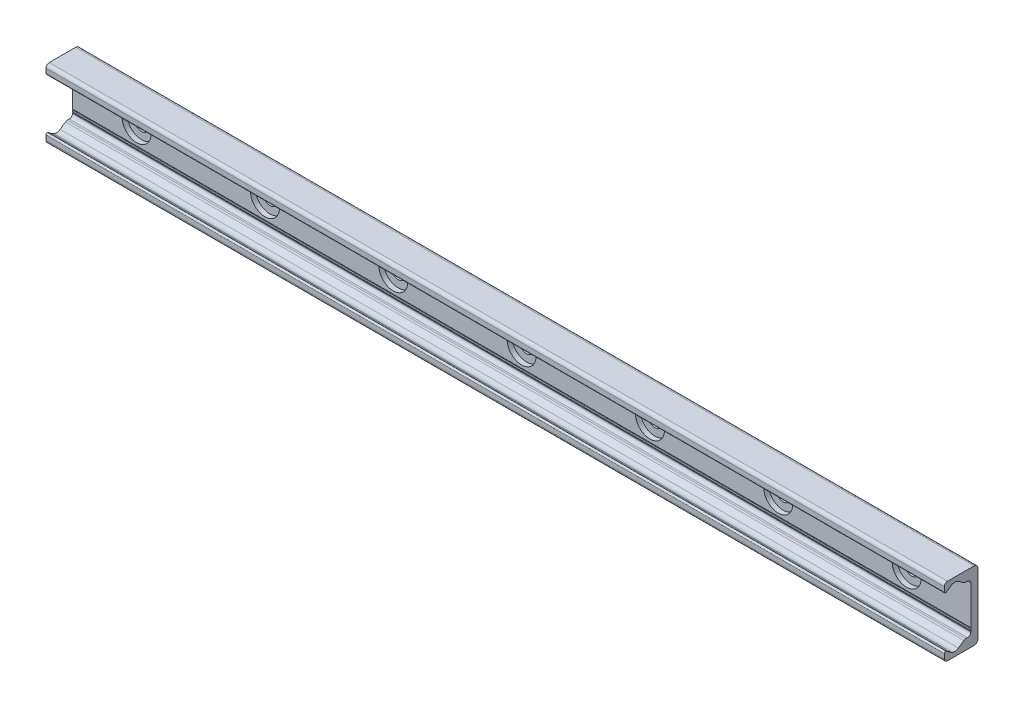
ISO-10303-21;
HEADER;
FILE_DESCRIPTION(('STEP AP214'),'2;1');
FILE_NAME('part.step','',(''),(''),'','','');
FILE_SCHEMA(('AUTOMOTIVE_DESIGN { 1 0 10303 214 1 1 1 1 }'));
ENDSEC;
DATA;
#1=APPLICATION_CONTEXT('core data for automotive mechanical design processes');
#2=APPLICATION_PROTOCOL_DEFINITION('international standard','automotive_design',2000,#1);
#3=PRODUCT_CONTEXT('',#1,'mechanical');
#4=PRODUCT('Part','Part','',(#3));
#5=PRODUCT_RELATED_PRODUCT_CATEGORY('part','',(#4));
#6=PRODUCT_DEFINITION_FORMATION('','',#4);
#7=PRODUCT_DEFINITION_CONTEXT('part definition',#1,'design');
#8=PRODUCT_DEFINITION('design','',#6,#7);
#9=PRODUCT_DEFINITION_SHAPE('','',#8);
#10=(LENGTH_UNIT() NAMED_UNIT(*) SI_UNIT(.MILLI.,.METRE.));
#11=(NAMED_UNIT(*) PLANE_ANGLE_UNIT() SI_UNIT($,.RADIAN.));
#12=(NAMED_UNIT(*) SI_UNIT($,.STERADIAN.) SOLID_ANGLE_UNIT());
#13=UNCERTAINTY_MEASURE_WITH_UNIT(LENGTH_MEASURE(1.E-05),#10,'distance_accuracy_value','');
#14=(GEOMETRIC_REPRESENTATION_CONTEXT(3) GLOBAL_UNCERTAINTY_ASSIGNED_CONTEXT((#13)) GLOBAL_UNIT_ASSIGNED_CONTEXT((#10,
#11,#12)) REPRESENTATION_CONTEXT('',''));
#15=CARTESIAN_POINT('',(0.,0.,0.));
#16=DIRECTION('',(0.,0.,1.));
#17=DIRECTION('',(1.,0.,0.));
#18=AXIS2_PLACEMENT_3D('',#15,#16,#17);
#19=CARTESIAN_POINT('',(-240.,0.,1.39999999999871));
#20=DIRECTION('',(0.,0.,1.));
#21=DIRECTION('',(1.,0.,0.));
#22=AXIS2_PLACEMENT_3D('',#19,#20,#21);
#23=PLANE('',#22);
#24=CARTESIAN_POINT('',(-240.,0.,1.39999999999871));
#25=DIRECTION('',(0.,0.,1.));
#26=DIRECTION('',(1.,0.,0.));
#27=AXIS2_PLACEMENT_3D('',#24,#25,#26);
#28=CIRCLE('',#27,4.49999999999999);
#29=CARTESIAN_POINT('',(-235.5,0.,1.39999999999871));
#30=VERTEX_POINT('',#29);
#31=EDGE_CURVE('E514',#30,#30,#28,.T.);
#32=ORIENTED_EDGE('',*,*,#31,.F.);
#33=EDGE_LOOP('',(#32));
#34=FACE_BOUND('',#33,.T.);
#35=CARTESIAN_POINT('',(-240.,0.,1.39999999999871));
#36=DIRECTION('',(0.,0.,1.));
#37=DIRECTION('',(1.,0.,0.));
#38=AXIS2_PLACEMENT_3D('',#35,#36,#37);
#39=CIRCLE('',#38,9.00000000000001);
#40=CARTESIAN_POINT('',(-231.,0.,1.39999999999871));
#41=VERTEX_POINT('',#40);
#42=EDGE_CURVE('E11',#41,#41,#39,.T.);
#43=ORIENTED_EDGE('',*,*,#42,.T.);
#44=EDGE_LOOP('',(#43));
#45=FACE_BOUND('',#44,.T.);
#46=ADVANCED_FACE('F39',(#34,#45),#23,.T.);
#47=CARTESIAN_POINT('',(-240.,0.,1.39999999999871));
#48=DIRECTION('',(0.,0.,1.));
#49=DIRECTION('',(1.,0.,0.));
#50=AXIS2_PLACEMENT_3D('',#47,#48,#49);
#51=CYLINDRICAL_SURFACE('',#50,9.00000000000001);
#52=CARTESIAN_POINT('',(-240.,0.,4.49999999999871));
#53=DIRECTION('',(0.,0.,1.));
#54=DIRECTION('',(1.,0.,0.));
#55=AXIS2_PLACEMENT_3D('',#52,#53,#54);
#56=CIRCLE('',#55,9.00000000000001);
#57=CARTESIAN_POINT('',(-231.,0.,4.49999999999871));
#58=VERTEX_POINT('',#57);
#59=EDGE_CURVE('E49',#58,#58,#56,.T.);
#60=CARTESIAN_POINT('',(-231.,0.,1.39999999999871));
#61=CARTESIAN_POINT('',(-231.,0.,1.43229166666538));
#62=CARTESIAN_POINT('',(-231.,0.,1.46458333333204));
#63=CARTESIAN_POINT('',(-231.,0.,1.52916666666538));
#64=CARTESIAN_POINT('',(-231.,0.,1.56145833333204));
#65=CARTESIAN_POINT('',(-231.,0.,1.62604166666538));
#66=CARTESIAN_POINT('',(-231.,0.,1.65833333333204));
#67=CARTESIAN_POINT('',(-231.,0.,1.72291666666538));
#68=CARTESIAN_POINT('',(-231.,0.,1.75520833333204));
#69=CARTESIAN_POINT('',(-231.,0.,1.81979166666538));
#70=CARTESIAN_POINT('',(-231.,0.,1.85208333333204));
#71=CARTESIAN_POINT('',(-231.,0.,1.91666666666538));
#72=CARTESIAN_POINT('',(-231.,0.,1.94895833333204));
#73=CARTESIAN_POINT('',(-231.,0.,2.01354166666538));
#74=CARTESIAN_POINT('',(-231.,0.,2.04583333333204));
#75=CARTESIAN_POINT('',(-231.,0.,2.11041666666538));
#76=CARTESIAN_POINT('',(-231.,0.,2.14270833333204));
#77=CARTESIAN_POINT('',(-231.,0.,2.20729166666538));
#78=CARTESIAN_POINT('',(-231.,0.,2.23958333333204));
#79=CARTESIAN_POINT('',(-231.,0.,2.30416666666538));
#80=CARTESIAN_POINT('',(-231.,0.,2.33645833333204));
#81=CARTESIAN_POINT('',(-231.,0.,2.40104166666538));
#82=CARTESIAN_POINT('',(-231.,0.,2.43333333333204));
#83=CARTESIAN_POINT('',(-231.,0.,2.49791666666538));
#84=CARTESIAN_POINT('',(-231.,0.,2.53020833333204));
#85=CARTESIAN_POINT('',(-231.,0.,2.59479166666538));
#86=CARTESIAN_POINT('',(-231.,0.,2.62708333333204));
#87=CARTESIAN_POINT('',(-231.,0.,2.69166666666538));
#88=CARTESIAN_POINT('',(-231.,0.,2.72395833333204));
#89=CARTESIAN_POINT('',(-231.,0.,2.78854166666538));
#90=CARTESIAN_POINT('',(-231.,0.,2.82083333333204));
#91=CARTESIAN_POINT('',(-231.,0.,2.88541666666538));
#92=CARTESIAN_POINT('',(-231.,0.,2.91770833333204));
#93=CARTESIAN_POINT('',(-231.,0.,2.98229166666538));
#94=CARTESIAN_POINT('',(-231.,0.,3.01458333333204));
#95=CARTESIAN_POINT('',(-231.,0.,3.07916666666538));
#96=CARTESIAN_POINT('',(-231.,0.,3.11145833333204));
#97=CARTESIAN_POINT('',(-231.,0.,3.17604166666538));
#98=CARTESIAN_POINT('',(-231.,0.,3.20833333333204));
#99=CARTESIAN_POINT('',(-231.,0.,3.27291666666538));
#100=CARTESIAN_POINT('',(-231.,0.,3.30520833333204));
#101=CARTESIAN_POINT('',(-231.,0.,3.36979166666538));
#102=CARTESIAN_POINT('',(-231.,0.,3.40208333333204));
#103=CARTESIAN_POINT('',(-231.,0.,3.46666666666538));
#104=CARTESIAN_POINT('',(-231.,0.,3.49895833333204));
#105=CARTESIAN_POINT('',(-231.,0.,3.56354166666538));
#106=CARTESIAN_POINT('',(-231.,0.,3.59583333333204));
#107=CARTESIAN_POINT('',(-231.,0.,3.66041666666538));
#108=CARTESIAN_POINT('',(-231.,0.,3.69270833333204));
#109=CARTESIAN_POINT('',(-231.,0.,3.75729166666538));
#110=CARTESIAN_POINT('',(-231.,0.,3.78958333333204));
#111=CARTESIAN_POINT('',(-231.,0.,3.85416666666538));
#112=CARTESIAN_POINT('',(-231.,0.,3.88645833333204));
#113=CARTESIAN_POINT('',(-231.,0.,3.95104166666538));
#114=CARTESIAN_POINT('',(-231.,0.,3.98333333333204));
#115=CARTESIAN_POINT('',(-231.,0.,4.04791666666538));
#116=CARTESIAN_POINT('',(-231.,0.,4.08020833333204));
#117=CARTESIAN_POINT('',(-231.,0.,4.14479166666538));
#118=CARTESIAN_POINT('',(-231.,0.,4.17708333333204));
#119=CARTESIAN_POINT('',(-231.,0.,4.24166666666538));
#120=CARTESIAN_POINT('',(-231.,0.,4.27395833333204));
#121=CARTESIAN_POINT('',(-231.,0.,4.33854166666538));
#122=CARTESIAN_POINT('',(-231.,0.,4.37083333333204));
#123=CARTESIAN_POINT('',(-231.,0.,4.43541666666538));
#124=CARTESIAN_POINT('',(-231.,0.,4.46770833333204));
#125=CARTESIAN_POINT('',(-231.,0.,4.49999999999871));
#126=B_SPLINE_CURVE_WITH_KNOTS('',3,(#60,#61,#62,#63,#64,#65,#66,#67,#68,#69,#70,#71,#72,#73,
#74,#75,#76,#77,#78,#79,#80,#81,#82,#83,#84,#85,#86,#87,#88,#89,#90,#91,#92,#93,#94,#95,#96,#97,
#98,#99,#100,#101,#102,#103,#104,#105,#106,#107,#108,#109,#110,#111,#112,#113,#114,#115,#116,
#117,#118,#119,#120,#121,#122,#123,#124,#125),.UNSPECIFIED.,.F.,.F.,(4,2,2,2,2,2,2,2,2,2,2,2,2,
2,2,2,2,2,2,2,2,2,2,2,2,2,2,2,2,2,2,2,4),(0.,0.0968750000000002,0.19375,0.290625,0.3875,
0.484375,0.58125,0.678125,0.775,0.871875,0.96875,1.065625,1.1625,1.259375,1.35625,1.453125,1.55,
1.646875,1.74375,1.840625,1.9375,2.034375,2.13125,2.228125,2.325,2.421875,2.51875,2.615625,
2.7125,2.809375,2.90625,3.003125,3.1),.UNSPECIFIED.);
#127=EDGE_CURVE('BSEAM484',#41,#58,#126,.T.);
#128=ORIENTED_EDGE('',*,*,#42,.F.);
#129=ORIENTED_EDGE('',*,*,#59,.T.);
#130=ORIENTED_EDGE('',*,*,#127,.T.);
#131=ORIENTED_EDGE('',*,*,#127,.F.);
#132=EDGE_LOOP('',(#128,#130,#129,#131));
#133=FACE_BOUND('',#132,.T.);
#134=ADVANCED_FACE('F484',(#133),#51,.F.);
#135=CARTESIAN_POINT('',(-160.,0.,1.39999999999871));
#136=DIRECTION('',(0.,0.,1.));
#137=DIRECTION('',(1.,0.,0.));
#138=AXIS2_PLACEMENT_3D('',#135,#136,#137);
#139=PLANE('',#138);
#140=CARTESIAN_POINT('',(-160.,0.,1.39999999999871));
#141=DIRECTION('',(0.,0.,1.));
#142=DIRECTION('',(1.,0.,0.));
#143=AXIS2_PLACEMENT_3D('',#140,#141,#142);
#144=CIRCLE('',#143,4.49999999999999);
#145=CARTESIAN_POINT('',(-155.5,0.,1.39999999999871));
#146=VERTEX_POINT('',#145);
#147=EDGE_CURVE('E518',#146,#146,#144,.T.);
#148=ORIENTED_EDGE('',*,*,#147,.F.);
#149=EDGE_LOOP('',(#148));
#150=FACE_BOUND('',#149,.T.);
#151=CARTESIAN_POINT('',(-160.,0.,1.39999999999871));
#152=DIRECTION('',(0.,0.,1.));
#153=DIRECTION('',(1.,0.,0.));
#154=AXIS2_PLACEMENT_3D('',#151,#152,#153);
#155=CIRCLE('',#154,9.00000000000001);
#156=CARTESIAN_POINT('',(-151.,0.,1.39999999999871));
#157=VERTEX_POINT('',#156);
#158=EDGE_CURVE('E474',#157,#157,#155,.T.);
#159=ORIENTED_EDGE('',*,*,#158,.T.);
#160=EDGE_LOOP('',(#159));
#161=FACE_BOUND('',#160,.T.);
#162=ADVANCED_FACE('F509',(#150,#161),#139,.T.);
#163=CARTESIAN_POINT('',(-160.,0.,1.39999999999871));
#164=DIRECTION('',(0.,0.,1.));
#165=DIRECTION('',(1.,0.,0.));
#166=AXIS2_PLACEMENT_3D('',#163,#164,#165);
#167=CYLINDRICAL_SURFACE('',#166,9.00000000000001);
#168=CARTESIAN_POINT('',(-160.,0.,4.49999999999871));
#169=DIRECTION('',(0.,0.,1.));
#170=DIRECTION('',(1.,0.,0.));
#171=AXIS2_PLACEMENT_3D('',#168,#169,#170);
#172=CIRCLE('',#171,9.00000000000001);
#173=CARTESIAN_POINT('',(-151.,0.,4.49999999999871));
#174=VERTEX_POINT('',#173);
#175=EDGE_CURVE('E470',#174,#174,#172,.T.);
#176=CARTESIAN_POINT('',(-151.,0.,1.39999999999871));
#177=CARTESIAN_POINT('',(-151.,0.,1.43229166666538));
#178=CARTESIAN_POINT('',(-151.,0.,1.46458333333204));
#179=CARTESIAN_POINT('',(-151.,0.,1.52916666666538));
#180=CARTESIAN_POINT('',(-151.,0.,1.56145833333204));
#181=CARTESIAN_POINT('',(-151.,0.,1.62604166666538));
#182=CARTESIAN_POINT('',(-151.,0.,1.65833333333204));
#183=CARTESIAN_POINT('',(-151.,0.,1.72291666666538));
#184=CARTESIAN_POINT('',(-151.,0.,1.75520833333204));
#185=CARTESIAN_POINT('',(-151.,0.,1.81979166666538));
#186=CARTESIAN_POINT('',(-151.,0.,1.85208333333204));
#187=CARTESIAN_POINT('',(-151.,0.,1.91666666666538));
#188=CARTESIAN_POINT('',(-151.,0.,1.94895833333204));
#189=CARTESIAN_POINT('',(-151.,0.,2.01354166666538));
#190=CARTESIAN_POINT('',(-151.,0.,2.04583333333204));
#191=CARTESIAN_POINT('',(-151.,0.,2.11041666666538));
#192=CARTESIAN_POINT('',(-151.,0.,2.14270833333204));
#193=CARTESIAN_POINT('',(-151.,0.,2.20729166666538));
#194=CARTESIAN_POINT('',(-151.,0.,2.23958333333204));
#195=CARTESIAN_POINT('',(-151.,0.,2.30416666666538));
#196=CARTESIAN_POINT('',(-151.,0.,2.33645833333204));
#197=CARTESIAN_POINT('',(-151.,0.,2.40104166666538));
#198=CARTESIAN_POINT('',(-151.,0.,2.43333333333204));
#199=CARTESIAN_POINT('',(-151.,0.,2.49791666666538));
#200=CARTESIAN_POINT('',(-151.,0.,2.53020833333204));
#201=CARTESIAN_POINT('',(-151.,0.,2.59479166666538));
#202=CARTESIAN_POINT('',(-151.,0.,2.62708333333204));
#203=CARTESIAN_POINT('',(-151.,0.,2.69166666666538));
#204=CARTESIAN_POINT('',(-151.,0.,2.72395833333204));
#205=CARTESIAN_POINT('',(-151.,0.,2.78854166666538));
#206=CARTESIAN_POINT('',(-151.,0.,2.82083333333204));
#207=CARTESIAN_POINT('',(-151.,0.,2.88541666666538));
#208=CARTESIAN_POINT('',(-151.,0.,2.91770833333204));
#209=CARTESIAN_POINT('',(-151.,0.,2.98229166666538));
#210=CARTESIAN_POINT('',(-151.,0.,3.01458333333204));
#211=CARTESIAN_POINT('',(-151.,0.,3.07916666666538));
#212=CARTESIAN_POINT('',(-151.,0.,3.11145833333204));
#213=CARTESIAN_POINT('',(-151.,0.,3.17604166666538));
#214=CARTESIAN_POINT('',(-151.,0.,3.20833333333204));
#215=CARTESIAN_POINT('',(-151.,0.,3.27291666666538));
#216=CARTESIAN_POINT('',(-151.,0.,3.30520833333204));
#217=CARTESIAN_POINT('',(-151.,0.,3.36979166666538));
#218=CARTESIAN_POINT('',(-151.,0.,3.40208333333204));
#219=CARTESIAN_POINT('',(-151.,0.,3.46666666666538));
#220=CARTESIAN_POINT('',(-151.,0.,3.49895833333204));
#221=CARTESIAN_POINT('',(-151.,0.,3.56354166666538));
#222=CARTESIAN_POINT('',(-151.,0.,3.59583333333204));
#223=CARTESIAN_POINT('',(-151.,0.,3.66041666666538));
#224=CARTESIAN_POINT('',(-151.,0.,3.69270833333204));
#225=CARTESIAN_POINT('',(-151.,0.,3.75729166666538));
#226=CARTESIAN_POINT('',(-151.,0.,3.78958333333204));
#227=CARTESIAN_POINT('',(-151.,0.,3.85416666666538));
#228=CARTESIAN_POINT('',(-151.,0.,3.88645833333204));
#229=CARTESIAN_POINT('',(-151.,0.,3.95104166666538));
#230=CARTESIAN_POINT('',(-151.,0.,3.98333333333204));
#231=CARTESIAN_POINT('',(-151.,0.,4.04791666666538));
#232=CARTESIAN_POINT('',(-151.,0.,4.08020833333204));
#233=CARTESIAN_POINT('',(-151.,0.,4.14479166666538));
#234=CARTESIAN_POINT('',(-151.,0.,4.17708333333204));
#235=CARTESIAN_POINT('',(-151.,0.,4.24166666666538));
#236=CARTESIAN_POINT('',(-151.,0.,4.27395833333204));
#237=CARTESIAN_POINT('',(-151.,0.,4.33854166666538));
#238=CARTESIAN_POINT('',(-151.,0.,4.37083333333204));
#239=CARTESIAN_POINT('',(-151.,0.,4.43541666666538));
#240=CARTESIAN_POINT('',(-151.,0.,4.46770833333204));
#241=CARTESIAN_POINT('',(-151.,0.,4.49999999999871));
#242=B_SPLINE_CURVE_WITH_KNOTS('',3,(#176,#177,#178,#179,#180,#181,#182,#183,#184,#185,#186,
#187,#188,#189,#190,#191,#192,#193,#194,#195,#196,#197,#198,#199,#200,#201,#202,#203,#204,#205,
#206,#207,#208,#209,#210,#211,#212,#213,#214,#215,#216,#217,#218,#219,#220,#221,#222,#223,#224,
#225,#226,#227,#228,#229,#230,#231,#232,#233,#234,#235,#236,#237,#238,#239,#240,#241),
.UNSPECIFIED.,.F.,.F.,(4,2,2,2,2,2,2,2,2,2,2,2,2,2,2,2,2,2,2,2,2,2,2,2,2,2,2,2,2,2,2,2,4),(0.,
0.0968750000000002,0.19375,0.290625,0.3875,0.484375,0.58125,0.678125,0.775,0.871875,0.96875,
1.065625,1.1625,1.259375,1.35625,1.453125,1.55,1.646875,1.74375,1.840625,1.9375,2.034375,
2.13125,2.228125,2.325,2.421875,2.51875,2.615625,2.7125,2.809375,2.90625,3.003125,3.1),.UNSPECIFIED.);
#243=EDGE_CURVE('BSEAM888',#157,#174,#242,.T.);
#244=ORIENTED_EDGE('',*,*,#158,.F.);
#245=ORIENTED_EDGE('',*,*,#175,.T.);
#246=ORIENTED_EDGE('',*,*,#243,.T.);
#247=ORIENTED_EDGE('',*,*,#243,.F.);
#248=EDGE_LOOP('',(#244,#246,#245,#247));
#249=FACE_BOUND('',#248,.T.);
#250=ADVANCED_FACE('F888',(#249),#167,.F.);
#251=CARTESIAN_POINT('',(-80.,0.,1.39999999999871));
#252=DIRECTION('',(0.,0.,1.));
#253=DIRECTION('',(1.,0.,0.));
#254=AXIS2_PLACEMENT_3D('',#251,#252,#253);
#255=PLANE('',#254);
#256=CARTESIAN_POINT('',(-80.,0.,1.39999999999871));
#257=DIRECTION('',(0.,0.,1.));
#258=DIRECTION('',(1.,0.,0.));
#259=AXIS2_PLACEMENT_3D('',#256,#257,#258);
#260=CIRCLE('',#259,4.49999999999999);
#261=CARTESIAN_POINT('',(-75.5,0.,1.39999999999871));
#262=VERTEX_POINT('',#261);
#263=EDGE_CURVE('E523',#262,#262,#260,.T.);
#264=ORIENTED_EDGE('',*,*,#263,.F.);
#265=EDGE_LOOP('',(#264));
#266=FACE_BOUND('',#265,.T.);
#267=CARTESIAN_POINT('',(-80.,0.,1.39999999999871));
#268=DIRECTION('',(0.,0.,1.));
#269=DIRECTION('',(1.,0.,0.));
#270=AXIS2_PLACEMENT_3D('',#267,#268,#269);
#271=CIRCLE('',#270,9.00000000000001);
#272=CARTESIAN_POINT('',(-71.,0.,1.39999999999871));
#273=VERTEX_POINT('',#272);
#274=EDGE_CURVE('E466',#273,#273,#271,.T.);
#275=ORIENTED_EDGE('',*,*,#274,.T.);
#276=EDGE_LOOP('',(#275));
#277=FACE_BOUND('',#276,.T.);
#278=ADVANCED_FACE('F884',(#266,#277),#255,.T.);
#279=CARTESIAN_POINT('',(-80.,0.,1.39999999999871));
#280=DIRECTION('',(0.,0.,1.));
#281=DIRECTION('',(1.,0.,0.));
#282=AXIS2_PLACEMENT_3D('',#279,#280,#281);
#283=CYLINDRICAL_SURFACE('',#282,9.00000000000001);
#284=CARTESIAN_POINT('',(-80.,0.,4.49999999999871));
#285=DIRECTION('',(0.,0.,1.));
#286=DIRECTION('',(1.,0.,0.));
#287=AXIS2_PLACEMENT_3D('',#284,#285,#286);
#288=CIRCLE('',#287,9.00000000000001);
#289=CARTESIAN_POINT('',(-71.,0.,4.49999999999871));
#290=VERTEX_POINT('',#289);
#291=EDGE_CURVE('E462',#290,#290,#288,.T.);
#292=CARTESIAN_POINT('',(-71.,0.,1.39999999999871));
#293=CARTESIAN_POINT('',(-71.,0.,1.43229166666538));
#294=CARTESIAN_POINT('',(-71.,0.,1.46458333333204));
#295=CARTESIAN_POINT('',(-71.,0.,1.52916666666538));
#296=CARTESIAN_POINT('',(-71.,0.,1.56145833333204));
#297=CARTESIAN_POINT('',(-71.,0.,1.62604166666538));
#298=CARTESIAN_POINT('',(-71.,0.,1.65833333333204));
#299=CARTESIAN_POINT('',(-71.,0.,1.72291666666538));
#300=CARTESIAN_POINT('',(-71.,0.,1.75520833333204));
#301=CARTESIAN_POINT('',(-71.,0.,1.81979166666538));
#302=CARTESIAN_POINT('',(-71.,0.,1.85208333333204));
#303=CARTESIAN_POINT('',(-71.,0.,1.91666666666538));
#304=CARTESIAN_POINT('',(-71.,0.,1.94895833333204));
#305=CARTESIAN_POINT('',(-71.,0.,2.01354166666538));
#306=CARTESIAN_POINT('',(-71.,0.,2.04583333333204));
#307=CARTESIAN_POINT('',(-71.,0.,2.11041666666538));
#308=CARTESIAN_POINT('',(-71.,0.,2.14270833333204));
#309=CARTESIAN_POINT('',(-71.,0.,2.20729166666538));
#310=CARTESIAN_POINT('',(-71.,0.,2.23958333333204));
#311=CARTESIAN_POINT('',(-71.,0.,2.30416666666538));
#312=CARTESIAN_POINT('',(-71.,0.,2.33645833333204));
#313=CARTESIAN_POINT('',(-71.,0.,2.40104166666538));
#314=CARTESIAN_POINT('',(-71.,0.,2.43333333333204));
#315=CARTESIAN_POINT('',(-71.,0.,2.49791666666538));
#316=CARTESIAN_POINT('',(-71.,0.,2.53020833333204));
#317=CARTESIAN_POINT('',(-71.,0.,2.59479166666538));
#318=CARTESIAN_POINT('',(-71.,0.,2.62708333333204));
#319=CARTESIAN_POINT('',(-71.,0.,2.69166666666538));
#320=CARTESIAN_POINT('',(-71.,0.,2.72395833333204));
#321=CARTESIAN_POINT('',(-71.,0.,2.78854166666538));
#322=CARTESIAN_POINT('',(-71.,0.,2.82083333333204));
#323=CARTESIAN_POINT('',(-71.,0.,2.88541666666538));
#324=CARTESIAN_POINT('',(-71.,0.,2.91770833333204));
#325=CARTESIAN_POINT('',(-71.,0.,2.98229166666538));
#326=CARTESIAN_POINT('',(-71.,0.,3.01458333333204));
#327=CARTESIAN_POINT('',(-71.,0.,3.07916666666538));
#328=CARTESIAN_POINT('',(-71.,0.,3.11145833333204));
#329=CARTESIAN_POINT('',(-71.,0.,3.17604166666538));
#330=CARTESIAN_POINT('',(-71.,0.,3.20833333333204));
#331=CARTESIAN_POINT('',(-71.,0.,3.27291666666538));
#332=CARTESIAN_POINT('',(-71.,0.,3.30520833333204));
#333=CARTESIAN_POINT('',(-71.,0.,3.36979166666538));
#334=CARTESIAN_POINT('',(-71.,0.,3.40208333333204));
#335=CARTESIAN_POINT('',(-71.,0.,3.46666666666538));
#336=CARTESIAN_POINT('',(-71.,0.,3.49895833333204));
#337=CARTESIAN_POINT('',(-71.,0.,3.56354166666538));
#338=CARTESIAN_POINT('',(-71.,0.,3.59583333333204));
#339=CARTESIAN_POINT('',(-71.,0.,3.66041666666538));
#340=CARTESIAN_POINT('',(-71.,0.,3.69270833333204));
#341=CARTESIAN_POINT('',(-71.,0.,3.75729166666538));
#342=CARTESIAN_POINT('',(-71.,0.,3.78958333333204));
#343=CARTESIAN_POINT('',(-71.,0.,3.85416666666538));
#344=CARTESIAN_POINT('',(-71.,0.,3.88645833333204));
#345=CARTESIAN_POINT('',(-71.,0.,3.95104166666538));
#346=CARTESIAN_POINT('',(-71.,0.,3.98333333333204));
#347=CARTESIAN_POINT('',(-71.,0.,4.04791666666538));
#348=CARTESIAN_POINT('',(-71.,0.,4.08020833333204));
#349=CARTESIAN_POINT('',(-71.,0.,4.14479166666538));
#350=CARTESIAN_POINT('',(-71.,0.,4.17708333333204));
#351=CARTESIAN_POINT('',(-71.,0.,4.24166666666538));
#352=CARTESIAN_POINT('',(-71.,0.,4.27395833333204));
#353=CARTESIAN_POINT('',(-71.,0.,4.33854166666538));
#354=CARTESIAN_POINT('',(-71.,0.,4.37083333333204));
#355=CARTESIAN_POINT('',(-71.,0.,4.43541666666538));
#356=CARTESIAN_POINT('',(-71.,0.,4.46770833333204));
#357=CARTESIAN_POINT('',(-71.,0.,4.49999999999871));
#358=B_SPLINE_CURVE_WITH_KNOTS('',3,(#292,#293,#294,#295,#296,#297,#298,#299,#300,#301,#302,
#303,#304,#305,#306,#307,#308,#309,#310,#311,#312,#313,#314,#315,#316,#317,#318,#319,#320,#321,
#322,#323,#324,#325,#326,#327,#328,#329,#330,#331,#332,#333,#334,#335,#336,#337,#338,#339,#340,
#341,#342,#343,#344,#345,#346,#347,#348,#349,#350,#351,#352,#353,#354,#355,#356,#357),
.UNSPECIFIED.,.F.,.F.,(4,2,2,2,2,2,2,2,2,2,2,2,2,2,2,2,2,2,2,2,2,2,2,2,2,2,2,2,2,2,2,2,4),(0.,
0.0968750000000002,0.19375,0.290625,0.3875,0.484375,0.58125,0.678125,0.775,0.871875,0.96875,
1.065625,1.1625,1.259375,1.35625,1.453125,1.55,1.646875,1.74375,1.840625,1.9375,2.034375,
2.13125,2.228125,2.325,2.421875,2.51875,2.615625,2.7125,2.809375,2.90625,3.003125,3.1),.UNSPECIFIED.);
#359=EDGE_CURVE('BSEAM880',#273,#290,#358,.T.);
#360=ORIENTED_EDGE('',*,*,#274,.F.);
#361=ORIENTED_EDGE('',*,*,#291,.T.);
#362=ORIENTED_EDGE('',*,*,#359,.T.);
#363=ORIENTED_EDGE('',*,*,#359,.F.);
#364=EDGE_LOOP('',(#360,#362,#361,#363));
#365=FACE_BOUND('',#364,.T.);
#366=ADVANCED_FACE('F880',(#365),#283,.F.);
#367=CARTESIAN_POINT('',(0.,0.,1.39999999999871));
#368=DIRECTION('',(0.,0.,1.));
#369=DIRECTION('',(1.,0.,0.));
#370=AXIS2_PLACEMENT_3D('',#367,#368,#369);
#371=PLANE('',#370);
#372=CARTESIAN_POINT('',(0.,0.,1.39999999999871));
#373=DIRECTION('',(0.,0.,1.));
#374=DIRECTION('',(1.,0.,0.));
#375=AXIS2_PLACEMENT_3D('',#372,#373,#374);
#376=CIRCLE('',#375,4.49999999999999);
#377=CARTESIAN_POINT('',(4.50000000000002,0.,1.39999999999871));
#378=VERTEX_POINT('',#377);
#379=EDGE_CURVE('E534',#378,#378,#376,.T.);
#380=ORIENTED_EDGE('',*,*,#379,.F.);
#381=EDGE_LOOP('',(#380));
#382=FACE_BOUND('',#381,.T.);
#383=CARTESIAN_POINT('',(0.,0.,1.39999999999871));
#384=DIRECTION('',(0.,0.,1.));
#385=DIRECTION('',(1.,0.,0.));
#386=AXIS2_PLACEMENT_3D('',#383,#384,#385);
#387=CIRCLE('',#386,9.00000000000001);
#388=CARTESIAN_POINT('',(9.00000000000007,0.,1.39999999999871));
#389=VERTEX_POINT('',#388);
#390=EDGE_CURVE('E458',#389,#389,#387,.T.);
#391=ORIENTED_EDGE('',*,*,#390,.T.);
#392=EDGE_LOOP('',(#391));
#393=FACE_BOUND('',#392,.T.);
#394=ADVANCED_FACE('F876',(#382,#393),#371,.T.);
#395=CARTESIAN_POINT('',(0.,0.,1.39999999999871));
#396=DIRECTION('',(0.,0.,1.));
#397=DIRECTION('',(1.,0.,0.));
#398=AXIS2_PLACEMENT_3D('',#395,#396,#397);
#399=CYLINDRICAL_SURFACE('',#398,9.00000000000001);
#400=CARTESIAN_POINT('',(0.,0.,4.49999999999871));
#401=DIRECTION('',(0.,0.,1.));
#402=DIRECTION('',(1.,0.,0.));
#403=AXIS2_PLACEMENT_3D('',#400,#401,#402);
#404=CIRCLE('',#403,9.00000000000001);
#405=CARTESIAN_POINT('',(9.00000000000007,0.,4.49999999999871));
#406=VERTEX_POINT('',#405);
#407=EDGE_CURVE('E454',#406,#406,#404,.T.);
#408=CARTESIAN_POINT('',(9.00000000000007,0.,1.39999999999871));
#409=CARTESIAN_POINT('',(9.00000000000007,0.,1.43229166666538));
#410=CARTESIAN_POINT('',(9.00000000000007,0.,1.46458333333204));
#411=CARTESIAN_POINT('',(9.00000000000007,0.,1.52916666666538));
#412=CARTESIAN_POINT('',(9.00000000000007,0.,1.56145833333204));
#413=CARTESIAN_POINT('',(9.00000000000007,0.,1.62604166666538));
#414=CARTESIAN_POINT('',(9.00000000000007,0.,1.65833333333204));
#415=CARTESIAN_POINT('',(9.00000000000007,0.,1.72291666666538));
#416=CARTESIAN_POINT('',(9.00000000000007,0.,1.75520833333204));
#417=CARTESIAN_POINT('',(9.00000000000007,0.,1.81979166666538));
#418=CARTESIAN_POINT('',(9.00000000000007,0.,1.85208333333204));
#419=CARTESIAN_POINT('',(9.00000000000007,0.,1.91666666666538));
#420=CARTESIAN_POINT('',(9.00000000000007,0.,1.94895833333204));
#421=CARTESIAN_POINT('',(9.00000000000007,0.,2.01354166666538));
#422=CARTESIAN_POINT('',(9.00000000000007,0.,2.04583333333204));
#423=CARTESIAN_POINT('',(9.00000000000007,0.,2.11041666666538));
#424=CARTESIAN_POINT('',(9.00000000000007,0.,2.14270833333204));
#425=CARTESIAN_POINT('',(9.00000000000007,0.,2.20729166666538));
#426=CARTESIAN_POINT('',(9.00000000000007,0.,2.23958333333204));
#427=CARTESIAN_POINT('',(9.00000000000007,0.,2.30416666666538));
#428=CARTESIAN_POINT('',(9.00000000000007,0.,2.33645833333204));
#429=CARTESIAN_POINT('',(9.00000000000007,0.,2.40104166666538));
#430=CARTESIAN_POINT('',(9.00000000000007,0.,2.43333333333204));
#431=CARTESIAN_POINT('',(9.00000000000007,0.,2.49791666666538));
#432=CARTESIAN_POINT('',(9.00000000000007,0.,2.53020833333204));
#433=CARTESIAN_POINT('',(9.00000000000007,0.,2.59479166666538));
#434=CARTESIAN_POINT('',(9.00000000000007,0.,2.62708333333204));
#435=CARTESIAN_POINT('',(9.00000000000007,0.,2.69166666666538));
#436=CARTESIAN_POINT('',(9.00000000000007,0.,2.72395833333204));
#437=CARTESIAN_POINT('',(9.00000000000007,0.,2.78854166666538));
#438=CARTESIAN_POINT('',(9.00000000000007,0.,2.82083333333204));
#439=CARTESIAN_POINT('',(9.00000000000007,0.,2.88541666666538));
#440=CARTESIAN_POINT('',(9.00000000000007,0.,2.91770833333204));
#441=CARTESIAN_POINT('',(9.00000000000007,0.,2.98229166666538));
#442=CARTESIAN_POINT('',(9.00000000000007,0.,3.01458333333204));
#443=CARTESIAN_POINT('',(9.00000000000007,0.,3.07916666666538));
#444=CARTESIAN_POINT('',(9.00000000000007,0.,3.11145833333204));
#445=CARTESIAN_POINT('',(9.00000000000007,0.,3.17604166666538));
#446=CARTESIAN_POINT('',(9.00000000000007,0.,3.20833333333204));
#447=CARTESIAN_POINT('',(9.00000000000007,0.,3.27291666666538));
#448=CARTESIAN_POINT('',(9.00000000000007,0.,3.30520833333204));
#449=CARTESIAN_POINT('',(9.00000000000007,0.,3.36979166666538));
#450=CARTESIAN_POINT('',(9.00000000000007,0.,3.40208333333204));
#451=CARTESIAN_POINT('',(9.00000000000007,0.,3.46666666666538));
#452=CARTESIAN_POINT('',(9.00000000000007,0.,3.49895833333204));
#453=CARTESIAN_POINT('',(9.00000000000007,0.,3.56354166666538));
#454=CARTESIAN_POINT('',(9.00000000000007,0.,3.59583333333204));
#455=CARTESIAN_POINT('',(9.00000000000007,0.,3.66041666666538));
#456=CARTESIAN_POINT('',(9.00000000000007,0.,3.69270833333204));
#457=CARTESIAN_POINT('',(9.00000000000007,0.,3.75729166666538));
#458=CARTESIAN_POINT('',(9.00000000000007,0.,3.78958333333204));
#459=CARTESIAN_POINT('',(9.00000000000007,0.,3.85416666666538));
#460=CARTESIAN_POINT('',(9.00000000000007,0.,3.88645833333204));
#461=CARTESIAN_POINT('',(9.00000000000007,0.,3.95104166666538));
#462=CARTESIAN_POINT('',(9.00000000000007,0.,3.98333333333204));
#463=CARTESIAN_POINT('',(9.00000000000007,0.,4.04791666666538));
#464=CARTESIAN_POINT('',(9.00000000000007,0.,4.08020833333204));
#465=CARTESIAN_POINT('',(9.00000000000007,0.,4.14479166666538));
#466=CARTESIAN_POINT('',(9.00000000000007,0.,4.17708333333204));
#467=CARTESIAN_POINT('',(9.00000000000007,0.,4.24166666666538));
#468=CARTESIAN_POINT('',(9.00000000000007,0.,4.27395833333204));
#469=CARTESIAN_POINT('',(9.00000000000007,0.,4.33854166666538));
#470=CARTESIAN_POINT('',(9.00000000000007,0.,4.37083333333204));
#471=CARTESIAN_POINT('',(9.00000000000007,0.,4.43541666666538));
#472=CARTESIAN_POINT('',(9.00000000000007,0.,4.46770833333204));
#473=CARTESIAN_POINT('',(9.00000000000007,0.,4.49999999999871));
#474=B_SPLINE_CURVE_WITH_KNOTS('',3,(#408,#409,#410,#411,#412,#413,#414,#415,#416,#417,#418,
#419,#420,#421,#422,#423,#424,#425,#426,#427,#428,#429,#430,#431,#432,#433,#434,#435,#436,#437,
#438,#439,#440,#441,#442,#443,#444,#445,#446,#447,#448,#449,#450,#451,#452,#453,#454,#455,#456,
#457,#458,#459,#460,#461,#462,#463,#464,#465,#466,#467,#468,#469,#470,#471,#472,#473),
.UNSPECIFIED.,.F.,.F.,(4,2,2,2,2,2,2,2,2,2,2,2,2,2,2,2,2,2,2,2,2,2,2,2,2,2,2,2,2,2,2,2,4),(0.,
0.0968750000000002,0.19375,0.290625,0.3875,0.484375,0.58125,0.678125,0.775,0.871875,0.96875,
1.065625,1.1625,1.259375,1.35625,1.453125,1.55,1.646875,1.74375,1.840625,1.9375,2.034375,
2.13125,2.228125,2.325,2.421875,2.51875,2.615625,2.7125,2.809375,2.90625,3.003125,3.1),.UNSPECIFIED.);
#475=EDGE_CURVE('BSEAM872',#389,#406,#474,.T.);
#476=ORIENTED_EDGE('',*,*,#390,.F.);
#477=ORIENTED_EDGE('',*,*,#407,.T.);
#478=ORIENTED_EDGE('',*,*,#475,.T.);
#479=ORIENTED_EDGE('',*,*,#475,.F.);
#480=EDGE_LOOP('',(#476,#478,#477,#479));
#481=FACE_BOUND('',#480,.T.);
#482=ADVANCED_FACE('F872',(#481),#399,.F.);
#483=CARTESIAN_POINT('',(80.,0.,1.39999999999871));
#484=DIRECTION('',(0.,0.,1.));
#485=DIRECTION('',(1.,0.,0.));
#486=AXIS2_PLACEMENT_3D('',#483,#484,#485);
#487=PLANE('',#486);
#488=CARTESIAN_POINT('',(80.,0.,1.39999999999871));
#489=DIRECTION('',(0.,0.,1.));
#490=DIRECTION('',(1.,0.,0.));
#491=AXIS2_PLACEMENT_3D('',#488,#489,#490);
#492=CIRCLE('',#491,4.49999999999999);
#493=CARTESIAN_POINT('',(84.5,0.,1.39999999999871));
#494=VERTEX_POINT('',#493);
#495=EDGE_CURVE('E538',#494,#494,#492,.T.);
#496=ORIENTED_EDGE('',*,*,#495,.F.);
#497=EDGE_LOOP('',(#496));
#498=FACE_BOUND('',#497,.T.);
#499=CARTESIAN_POINT('',(80.,0.,1.39999999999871));
#500=DIRECTION('',(0.,0.,1.));
#501=DIRECTION('',(1.,0.,0.));
#502=AXIS2_PLACEMENT_3D('',#499,#500,#501);
#503=CIRCLE('',#502,9.00000000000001);
#504=CARTESIAN_POINT('',(89.,0.,1.39999999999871));
#505=VERTEX_POINT('',#504);
#506=EDGE_CURVE('E450',#505,#505,#503,.T.);
#507=ORIENTED_EDGE('',*,*,#506,.T.);
#508=EDGE_LOOP('',(#507));
#509=FACE_BOUND('',#508,.T.);
#510=ADVANCED_FACE('F865',(#498,#509),#487,.T.);
#511=CARTESIAN_POINT('',(80.,0.,1.39999999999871));
#512=DIRECTION('',(0.,0.,1.));
#513=DIRECTION('',(1.,0.,0.));
#514=AXIS2_PLACEMENT_3D('',#511,#512,#513);
#515=CYLINDRICAL_SURFACE('',#514,9.00000000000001);
#516=CARTESIAN_POINT('',(80.,0.,4.49999999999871));
#517=DIRECTION('',(0.,0.,1.));
#518=DIRECTION('',(1.,0.,0.));
#519=AXIS2_PLACEMENT_3D('',#516,#517,#518);
#520=CIRCLE('',#519,9.00000000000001);
#521=CARTESIAN_POINT('',(89.,0.,4.49999999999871));
#522=VERTEX_POINT('',#521);
#523=EDGE_CURVE('E446',#522,#522,#520,.T.);
#524=CARTESIAN_POINT('',(89.,0.,1.39999999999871));
#525=CARTESIAN_POINT('',(89.,0.,1.43229166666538));
#526=CARTESIAN_POINT('',(89.,0.,1.46458333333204));
#527=CARTESIAN_POINT('',(89.,0.,1.52916666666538));
#528=CARTESIAN_POINT('',(89.,0.,1.56145833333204));
#529=CARTESIAN_POINT('',(89.,0.,1.62604166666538));
#530=CARTESIAN_POINT('',(89.,0.,1.65833333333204));
#531=CARTESIAN_POINT('',(89.,0.,1.72291666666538));
#532=CARTESIAN_POINT('',(89.,0.,1.75520833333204));
#533=CARTESIAN_POINT('',(89.,0.,1.81979166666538));
#534=CARTESIAN_POINT('',(89.,0.,1.85208333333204));
#535=CARTESIAN_POINT('',(89.,0.,1.91666666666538));
#536=CARTESIAN_POINT('',(89.,0.,1.94895833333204));
#537=CARTESIAN_POINT('',(89.,0.,2.01354166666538));
#538=CARTESIAN_POINT('',(89.,0.,2.04583333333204));
#539=CARTESIAN_POINT('',(89.,0.,2.11041666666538));
#540=CARTESIAN_POINT('',(89.,0.,2.14270833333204));
#541=CARTESIAN_POINT('',(89.,0.,2.20729166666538));
#542=CARTESIAN_POINT('',(89.,0.,2.23958333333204));
#543=CARTESIAN_POINT('',(89.,0.,2.30416666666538));
#544=CARTESIAN_POINT('',(89.,0.,2.33645833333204));
#545=CARTESIAN_POINT('',(89.,0.,2.40104166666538));
#546=CARTESIAN_POINT('',(89.,0.,2.43333333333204));
#547=CARTESIAN_POINT('',(89.,0.,2.49791666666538));
#548=CARTESIAN_POINT('',(89.,0.,2.53020833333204));
#549=CARTESIAN_POINT('',(89.,0.,2.59479166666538));
#550=CARTESIAN_POINT('',(89.,0.,2.62708333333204));
#551=CARTESIAN_POINT('',(89.,0.,2.69166666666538));
#552=CARTESIAN_POINT('',(89.,0.,2.72395833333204));
#553=CARTESIAN_POINT('',(89.,0.,2.78854166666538));
#554=CARTESIAN_POINT('',(89.,0.,2.82083333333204));
#555=CARTESIAN_POINT('',(89.,0.,2.88541666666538));
#556=CARTESIAN_POINT('',(89.,0.,2.91770833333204));
#557=CARTESIAN_POINT('',(89.,0.,2.98229166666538));
#558=CARTESIAN_POINT('',(89.,0.,3.01458333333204));
#559=CARTESIAN_POINT('',(89.,0.,3.07916666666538));
#560=CARTESIAN_POINT('',(89.,0.,3.11145833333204));
#561=CARTESIAN_POINT('',(89.,0.,3.17604166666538));
#562=CARTESIAN_POINT('',(89.,0.,3.20833333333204));
#563=CARTESIAN_POINT('',(89.,0.,3.27291666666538));
#564=CARTESIAN_POINT('',(89.,0.,3.30520833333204));
#565=CARTESIAN_POINT('',(89.,0.,3.36979166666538));
#566=CARTESIAN_POINT('',(89.,0.,3.40208333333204));
#567=CARTESIAN_POINT('',(89.,0.,3.46666666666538));
#568=CARTESIAN_POINT('',(89.,0.,3.49895833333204));
#569=CARTESIAN_POINT('',(89.,0.,3.56354166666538));
#570=CARTESIAN_POINT('',(89.,0.,3.59583333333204));
#571=CARTESIAN_POINT('',(89.,0.,3.66041666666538));
#572=CARTESIAN_POINT('',(89.,0.,3.69270833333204));
#573=CARTESIAN_POINT('',(89.,0.,3.75729166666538));
#574=CARTESIAN_POINT('',(89.,0.,3.78958333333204));
#575=CARTESIAN_POINT('',(89.,0.,3.85416666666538));
#576=CARTESIAN_POINT('',(89.,0.,3.88645833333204));
#577=CARTESIAN_POINT('',(89.,0.,3.95104166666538));
#578=CARTESIAN_POINT('',(89.,0.,3.98333333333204));
#579=CARTESIAN_POINT('',(89.,0.,4.04791666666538));
#580=CARTESIAN_POINT('',(89.,0.,4.08020833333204));
#581=CARTESIAN_POINT('',(89.,0.,4.14479166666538));
#582=CARTESIAN_POINT('',(89.,0.,4.17708333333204));
#583=CARTESIAN_POINT('',(89.,0.,4.24166666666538));
#584=CARTESIAN_POINT('',(89.,0.,4.27395833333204));
#585=CARTESIAN_POINT('',(89.,0.,4.33854166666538));
#586=CARTESIAN_POINT('',(89.,0.,4.37083333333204));
#587=CARTESIAN_POINT('',(89.,0.,4.43541666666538));
#588=CARTESIAN_POINT('',(89.,0.,4.46770833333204));
#589=CARTESIAN_POINT('',(89.,0.,4.49999999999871));
#590=B_SPLINE_CURVE_WITH_KNOTS('',3,(#524,#525,#526,#527,#528,#529,#530,#531,#532,#533,#534,
#535,#536,#537,#538,#539,#540,#541,#542,#543,#544,#545,#546,#547,#548,#549,#550,#551,#552,#553,
#554,#555,#556,#557,#558,#559,#560,#561,#562,#563,#564,#565,#566,#567,#568,#569,#570,#571,#572,
#573,#574,#575,#576,#577,#578,#579,#580,#581,#582,#583,#584,#585,#586,#587,#588,#589),
.UNSPECIFIED.,.F.,.F.,(4,2,2,2,2,2,2,2,2,2,2,2,2,2,2,2,2,2,2,2,2,2,2,2,2,2,2,2,2,2,2,2,4),(0.,
0.0968750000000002,0.19375,0.290625,0.3875,0.484375,0.58125,0.678125,0.775,0.871875,0.96875,
1.065625,1.1625,1.259375,1.35625,1.453125,1.55,1.646875,1.74375,1.840625,1.9375,2.034375,
2.13125,2.228125,2.325,2.421875,2.51875,2.615625,2.7125,2.809375,2.90625,3.003125,3.1),.UNSPECIFIED.);
#591=EDGE_CURVE('BSEAM858',#505,#522,#590,.T.);
#592=ORIENTED_EDGE('',*,*,#506,.F.);
#593=ORIENTED_EDGE('',*,*,#523,.T.);
#594=ORIENTED_EDGE('',*,*,#591,.T.);
#595=ORIENTED_EDGE('',*,*,#591,.F.);
#596=EDGE_LOOP('',(#592,#594,#593,#595));
#597=FACE_BOUND('',#596,.T.);
#598=ADVANCED_FACE('F858',(#597),#515,.F.);
#599=CARTESIAN_POINT('',(280.,0.,0.));
#600=DIRECTION('',(0.,0.,1.));
#601=DIRECTION('',(1.,0.,0.));
#602=AXIS2_PLACEMENT_3D('',#599,#600,#601);
#603=PLANE('',#602);
#604=CARTESIAN_POINT('',(160.,0.,0.));
#605=DIRECTION('',(0.,0.,1.));
#606=DIRECTION('',(1.,0.,0.));
#607=AXIS2_PLACEMENT_3D('',#604,#605,#606);
#608=CIRCLE('',#607,4.49999999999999);
#609=CARTESIAN_POINT('',(164.5,0.,0.));
#610=VERTEX_POINT('',#609);
#611=EDGE_CURVE('E527',#610,#610,#608,.T.);
#612=ORIENTED_EDGE('',*,*,#611,.T.);
#613=EDGE_LOOP('',(#612));
#614=FACE_BOUND('',#613,.T.);
#615=CARTESIAN_POINT('',(80.,0.,0.));
#616=DIRECTION('',(0.,0.,1.));
#617=DIRECTION('',(1.,0.,0.));
#618=AXIS2_PLACEMENT_3D('',#615,#616,#617);
#619=CIRCLE('',#618,4.49999999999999);
#620=CARTESIAN_POINT('',(84.5,0.,0.));
#621=VERTEX_POINT('',#620);
#622=EDGE_CURVE('E652',#621,#621,#619,.T.);
#623=ORIENTED_EDGE('',*,*,#622,.T.);
#624=EDGE_LOOP('',(#623));
#625=FACE_BOUND('',#624,.T.);
#626=CARTESIAN_POINT('',(0.,0.,0.));
#627=DIRECTION('',(0.,0.,1.));
#628=DIRECTION('',(1.,0.,0.));
#629=AXIS2_PLACEMENT_3D('',#626,#627,#628);
#630=CIRCLE('',#629,4.49999999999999);
#631=CARTESIAN_POINT('',(4.50000000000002,0.,0.));
#632=VERTEX_POINT('',#631);
#633=EDGE_CURVE('E646',#632,#632,#630,.T.);
#634=ORIENTED_EDGE('',*,*,#633,.T.);
#635=EDGE_LOOP('',(#634));
#636=FACE_BOUND('',#635,.T.);
#637=CARTESIAN_POINT('',(-80.,0.,0.));
#638=DIRECTION('',(0.,0.,1.));
#639=DIRECTION('',(1.,0.,0.));
#640=AXIS2_PLACEMENT_3D('',#637,#638,#639);
#641=CIRCLE('',#640,4.49999999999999);
#642=CARTESIAN_POINT('',(-75.5,0.,0.));
#643=VERTEX_POINT('',#642);
#644=EDGE_CURVE('E642',#643,#643,#641,.T.);
#645=ORIENTED_EDGE('',*,*,#644,.T.);
#646=EDGE_LOOP('',(#645));
#647=FACE_BOUND('',#646,.T.);
#648=CARTESIAN_POINT('',(-160.,0.,0.));
#649=DIRECTION('',(0.,0.,1.));
#650=DIRECTION('',(1.,0.,0.));
#651=AXIS2_PLACEMENT_3D('',#648,#649,#650);
#652=CIRCLE('',#651,4.49999999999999);
#653=CARTESIAN_POINT('',(-155.5,0.,0.));
#654=VERTEX_POINT('',#653);
#655=EDGE_CURVE('E637',#654,#654,#652,.T.);
#656=ORIENTED_EDGE('',*,*,#655,.T.);
#657=EDGE_LOOP('',(#656));
#658=FACE_BOUND('',#657,.T.);
#659=CARTESIAN_POINT('',(-240.,0.,0.));
#660=DIRECTION('',(0.,0.,1.));
#661=DIRECTION('',(1.,0.,0.));
#662=AXIS2_PLACEMENT_3D('',#659,#660,#661);
#663=CIRCLE('',#662,4.49999999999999);
#664=CARTESIAN_POINT('',(-235.5,0.,0.));
#665=VERTEX_POINT('',#664);
#666=EDGE_CURVE('E529',#665,#665,#663,.T.);
#667=ORIENTED_EDGE('',*,*,#666,.T.);
#668=EDGE_LOOP('',(#667));
#669=FACE_BOUND('',#668,.T.);
#670=CARTESIAN_POINT('',(240.,0.,0.));
#671=DIRECTION('',(0.,0.,1.));
#672=DIRECTION('',(1.,0.,0.));
#673=AXIS2_PLACEMENT_3D('',#670,#671,#672);
#674=CIRCLE('',#673,4.49999999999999);
#675=CARTESIAN_POINT('',(244.5,0.,0.));
#676=VERTEX_POINT('',#675);
#677=EDGE_CURVE('E550',#676,#676,#674,.T.);
#678=ORIENTED_EDGE('',*,*,#677,.T.);
#679=EDGE_LOOP('',(#678));
#680=FACE_BOUND('',#679,.T.);
#681=DIRECTION('',(0.,1.,0.));
#682=VECTOR('',#681,1.);
#683=CARTESIAN_POINT('',(-280.,0.,0.));
#684=LINE('',#683,#682);
#685=CARTESIAN_POINT('',(-280.,-19.,0.));
#686=VERTEX_POINT('',#685);
#687=CARTESIAN_POINT('',(-280.,19.,0.));
#688=VERTEX_POINT('',#687);
#689=EDGE_CURVE('E153',#686,#688,#684,.T.);
#690=ORIENTED_EDGE('',*,*,#689,.T.);
#691=DIRECTION('',(-1.,0.,0.));
#692=VECTOR('',#691,1.);
#693=CARTESIAN_POINT('',(280.,19.,0.));
#694=LINE('',#693,#692);
#695=CARTESIAN_POINT('',(280.,19.,0.));
#696=VERTEX_POINT('',#695);
#697=EDGE_CURVE('E442',#696,#688,#694,.T.);
#698=ORIENTED_EDGE('',*,*,#697,.F.);
#699=DIRECTION('',(0.,1.,0.));
#700=VECTOR('',#699,1.);
#701=CARTESIAN_POINT('',(280.,0.,0.));
#702=LINE('',#701,#700);
#703=CARTESIAN_POINT('',(280.,-19.,0.));
#704=VERTEX_POINT('',#703);
#705=EDGE_CURVE('E159',#704,#696,#702,.T.);
#706=ORIENTED_EDGE('',*,*,#705,.F.);
#707=DIRECTION('',(-1.,0.,0.));
#708=VECTOR('',#707,1.);
#709=CARTESIAN_POINT('',(280.,-19.,0.));
#710=LINE('',#709,#708);
#711=EDGE_CURVE('E259',#704,#686,#710,.T.);
#712=ORIENTED_EDGE('',*,*,#711,.T.);
#713=EDGE_LOOP('',(#690,#698,#706,#712));
#714=FACE_BOUND('',#713,.T.);
#715=ADVANCED_FACE('F660',(#614,#625,#636,#647,#658,#669,#680,#714),#603,.F.);
#716=CARTESIAN_POINT('',(280.,19.,2.5));
#717=DIRECTION('',(-1.,0.,0.));
#718=DIRECTION('',(0.,0.,1.));
#719=AXIS2_PLACEMENT_3D('',#716,#717,#718);
#720=CYLINDRICAL_SURFACE('',#719,2.5);
#721=CARTESIAN_POINT('',(-280.,19.,2.5));
#722=DIRECTION('',(1.,0.,0.));
#723=DIRECTION('',(0.,0.,-1.));
#724=AXIS2_PLACEMENT_3D('',#721,#722,#723);
#725=CIRCLE('',#724,2.5);
#726=CARTESIAN_POINT('',(-280.,21.5,2.5));
#727=VERTEX_POINT('',#726);
#728=EDGE_CURVE('E265',#688,#727,#725,.T.);
#729=ORIENTED_EDGE('',*,*,#728,.T.);
#730=DIRECTION('',(-1.,0.,0.));
#731=VECTOR('',#730,1.);
#732=CARTESIAN_POINT('',(280.,21.5,2.5));
#733=LINE('',#732,#731);
#734=CARTESIAN_POINT('',(280.,21.5,2.5));
#735=VERTEX_POINT('',#734);
#736=EDGE_CURVE('E438',#735,#727,#733,.T.);
#737=ORIENTED_EDGE('',*,*,#736,.F.);
#738=CARTESIAN_POINT('',(280.,19.,2.5));
#739=DIRECTION('',(1.,0.,0.));
#740=DIRECTION('',(0.,0.,-1.));
#741=AXIS2_PLACEMENT_3D('',#738,#739,#740);
#742=CIRCLE('',#741,2.5);
#743=EDGE_CURVE('E566',#696,#735,#742,.T.);
#744=ORIENTED_EDGE('',*,*,#743,.F.);
#745=ORIENTED_EDGE('',*,*,#697,.T.);
#746=EDGE_LOOP('',(#729,#737,#744,#745));
#747=FACE_BOUND('',#746,.T.);
#748=ADVANCED_FACE('F839',(#747),#720,.T.);
#749=CARTESIAN_POINT('',(280.,21.5,2.5));
#750=DIRECTION('',(0.,-1.,0.));
#751=DIRECTION('',(0.,0.,-1.));
#752=AXIS2_PLACEMENT_3D('',#749,#750,#751);
#753=PLANE('',#752);
#754=DIRECTION('',(0.,0.,1.));
#755=VECTOR('',#754,1.);
#756=CARTESIAN_POINT('',(-280.,21.5,2.5));
#757=LINE('',#756,#755);
#758=CARTESIAN_POINT('',(-280.,21.5,19.000000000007));
#759=VERTEX_POINT('',#758);
#760=EDGE_CURVE('E269',#727,#759,#757,.T.);
#761=ORIENTED_EDGE('',*,*,#760,.T.);
#762=DIRECTION('',(-1.,0.,0.));
#763=VECTOR('',#762,1.);
#764=CARTESIAN_POINT('',(280.,21.5,19.000000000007));
#765=LINE('',#764,#763);
#766=CARTESIAN_POINT('',(280.,21.5,19.000000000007));
#767=VERTEX_POINT('',#766);
#768=EDGE_CURVE('E434',#767,#759,#765,.T.);
#769=ORIENTED_EDGE('',*,*,#768,.F.);
#770=DIRECTION('',(0.,0.,1.));
#771=VECTOR('',#770,1.);
#772=CARTESIAN_POINT('',(280.,21.5,2.5));
#773=LINE('',#772,#771);
#774=EDGE_CURVE('E569',#735,#767,#773,.T.);
#775=ORIENTED_EDGE('',*,*,#774,.F.);
#776=ORIENTED_EDGE('',*,*,#736,.T.);
#777=EDGE_LOOP('',(#761,#769,#775,#776));
#778=FACE_BOUND('',#777,.T.);
#779=ADVANCED_FACE('F835',(#778),#753,.F.);
#780=CARTESIAN_POINT('',(280.,19.4999999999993,19.000000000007));
#781=DIRECTION('',(-1.,0.,0.));
#782=DIRECTION('',(0.,0.,1.));
#783=AXIS2_PLACEMENT_3D('',#780,#781,#782);
#784=CYLINDRICAL_SURFACE('',#783,2.00000000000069);
#785=CARTESIAN_POINT('',(-280.,19.4999999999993,19.000000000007));
#786=DIRECTION('',(1.,0.,0.));
#787=DIRECTION('',(0.,0.,-1.));
#788=AXIS2_PLACEMENT_3D('',#785,#786,#787);
#789=CIRCLE('',#788,2.00000000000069);
#790=CARTESIAN_POINT('',(-280.,19.4999999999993,21.0000000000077));
#791=VERTEX_POINT('',#790);
#792=EDGE_CURVE('E272',#759,#791,#789,.T.);
#793=ORIENTED_EDGE('',*,*,#792,.T.);
#794=DIRECTION('',(-1.,0.,0.));
#795=VECTOR('',#794,1.);
#796=CARTESIAN_POINT('',(280.,19.4999999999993,21.0000000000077));
#797=LINE('',#796,#795);
#798=CARTESIAN_POINT('',(280.,19.4999999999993,21.0000000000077));
#799=VERTEX_POINT('',#798);
#800=EDGE_CURVE('E430',#799,#791,#797,.T.);
#801=ORIENTED_EDGE('',*,*,#800,.F.);
#802=CARTESIAN_POINT('',(280.,19.4999999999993,19.000000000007));
#803=DIRECTION('',(1.,0.,0.));
#804=DIRECTION('',(0.,0.,-1.));
#805=AXIS2_PLACEMENT_3D('',#802,#803,#804);
#806=CIRCLE('',#805,2.00000000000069);
#807=EDGE_CURVE('E572',#767,#799,#806,.T.);
#808=ORIENTED_EDGE('',*,*,#807,.F.);
#809=ORIENTED_EDGE('',*,*,#768,.T.);
#810=EDGE_LOOP('',(#793,#801,#808,#809));
#811=FACE_BOUND('',#810,.T.);
#812=ADVANCED_FACE('F830',(#811),#784,.T.);
#813=CARTESIAN_POINT('',(280.,19.4999999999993,21.0000000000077));
#814=DIRECTION('',(0.,0.,-1.));
#815=DIRECTION('',(-1.,0.,0.));
#816=AXIS2_PLACEMENT_3D('',#813,#814,#815);
#817=PLANE('',#816);
#818=DIRECTION('',(0.,-1.,0.));
#819=VECTOR('',#818,1.);
#820=CARTESIAN_POINT('',(-280.,19.4999999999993,21.0000000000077));
#821=LINE('',#820,#819);
#822=CARTESIAN_POINT('',(-280.,16.6250570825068,21.0000000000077));
#823=VERTEX_POINT('',#822);
#824=EDGE_CURVE('E275',#791,#823,#821,.T.);
#825=ORIENTED_EDGE('',*,*,#824,.T.);
#826=DIRECTION('',(-1.,0.,0.));
#827=VECTOR('',#826,1.);
#828=CARTESIAN_POINT('',(280.,16.6250570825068,21.0000000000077));
#829=LINE('',#828,#827);
#830=CARTESIAN_POINT('',(280.,16.6250570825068,21.0000000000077));
#831=VERTEX_POINT('',#830);
#832=EDGE_CURVE('E426',#831,#823,#829,.T.);
#833=ORIENTED_EDGE('',*,*,#832,.F.);
#834=DIRECTION('',(0.,-1.,0.));
#835=VECTOR('',#834,1.);
#836=CARTESIAN_POINT('',(280.,19.4999999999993,21.0000000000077));
#837=LINE('',#836,#835);
#838=EDGE_CURVE('E575',#799,#831,#837,.T.);
#839=ORIENTED_EDGE('',*,*,#838,.F.);
#840=ORIENTED_EDGE('',*,*,#800,.T.);
#841=EDGE_LOOP('',(#825,#833,#839,#840));
#842=FACE_BOUND('',#841,.T.);
#843=ADVANCED_FACE('F825',(#842),#817,.F.);
#844=CARTESIAN_POINT('',(280.,16.6250570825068,20.1700000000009));
#845=DIRECTION('',(-1.,0.,0.));
#846=DIRECTION('',(0.,0.,1.));
#847=AXIS2_PLACEMENT_3D('',#844,#845,#846);
#848=CYLINDRICAL_SURFACE('',#847,0.83000000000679);
#849=CARTESIAN_POINT('',(-280.,16.6250570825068,20.1700000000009));
#850=DIRECTION('',(1.,0.,0.));
#851=DIRECTION('',(0.,0.,-1.));
#852=AXIS2_PLACEMENT_3D('',#849,#850,#851);
#853=CIRCLE('',#852,0.83000000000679);
#854=CARTESIAN_POINT('',(-280.,15.9451608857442,19.6939315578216));
#855=VERTEX_POINT('',#854);
#856=EDGE_CURVE('E278',#823,#855,#853,.T.);
#857=ORIENTED_EDGE('',*,*,#856,.T.);
#858=DIRECTION('',(-1.,0.,0.));
#859=VECTOR('',#858,1.);
#860=CARTESIAN_POINT('',(280.,15.9451608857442,19.6939315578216));
#861=LINE('',#860,#859);
#862=CARTESIAN_POINT('',(280.,15.9451608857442,19.6939315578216));
#863=VERTEX_POINT('',#862);
#864=EDGE_CURVE('E422',#863,#855,#861,.T.);
#865=ORIENTED_EDGE('',*,*,#864,.F.);
#866=CARTESIAN_POINT('',(280.,16.6250570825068,20.1700000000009));
#867=DIRECTION('',(1.,0.,0.));
#868=DIRECTION('',(0.,0.,-1.));
#869=AXIS2_PLACEMENT_3D('',#866,#867,#868);
#870=CIRCLE('',#869,0.83000000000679);
#871=EDGE_CURVE('E578',#831,#863,#870,.T.);
#872=ORIENTED_EDGE('',*,*,#871,.F.);
#873=ORIENTED_EDGE('',*,*,#832,.T.);
#874=EDGE_LOOP('',(#857,#865,#872,#873));
#875=FACE_BOUND('',#874,.T.);
#876=ADVANCED_FACE('F821',(#875),#848,.T.);
#877=CARTESIAN_POINT('',(280.,15.9451608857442,19.6939315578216));
#878=DIRECTION('',(0.,0.81915204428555,0.573576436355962));
#879=DIRECTION('',(0.,-0.573576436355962,0.81915204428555));
#880=AXIS2_PLACEMENT_3D('',#877,#878,#879);
#881=PLANE('',#880);
#882=DIRECTION('',(0.,0.573576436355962,-0.81915204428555));
#883=VECTOR('',#882,1.);
#884=CARTESIAN_POINT('',(-280.,15.9451608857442,19.6939315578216));
#885=LINE('',#884,#883);
#886=CARTESIAN_POINT('',(-280.,17.975500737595,16.7943057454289));
#887=VERTEX_POINT('',#886);
#888=EDGE_CURVE('E281',#855,#887,#885,.T.);
#889=ORIENTED_EDGE('',*,*,#888,.T.);
#890=DIRECTION('',(-1.,0.,0.));
#891=VECTOR('',#890,1.);
#892=CARTESIAN_POINT('',(280.,17.975500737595,16.7943057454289));
#893=LINE('',#892,#891);
#894=CARTESIAN_POINT('',(280.,17.975500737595,16.7943057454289));
#895=VERTEX_POINT('',#894);
#896=EDGE_CURVE('E418',#895,#887,#893,.T.);
#897=ORIENTED_EDGE('',*,*,#896,.F.);
#898=DIRECTION('',(0.,0.573576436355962,-0.81915204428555));
#899=VECTOR('',#898,1.);
#900=CARTESIAN_POINT('',(280.,15.9451608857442,19.6939315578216));
#901=LINE('',#900,#899);
#902=EDGE_CURVE('E581',#863,#895,#901,.T.);
#903=ORIENTED_EDGE('',*,*,#902,.F.);
#904=ORIENTED_EDGE('',*,*,#864,.T.);
#905=EDGE_LOOP('',(#889,#897,#903,#904));
#906=FACE_BOUND('',#905,.T.);
#907=ADVANCED_FACE('F816',(#906),#881,.F.);
#908=CARTESIAN_POINT('',(280.,14.6988925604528,14.5000000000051));
#909=DIRECTION('',(-1.,0.,0.));
#910=DIRECTION('',(0.,0.,1.));
#911=AXIS2_PLACEMENT_3D('',#908,#909,#910);
#912=CYLINDRICAL_SURFACE('',#911,3.99999999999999);
#913=CARTESIAN_POINT('',(-280.,14.6988925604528,14.5000000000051));
#914=DIRECTION('',(-1.,0.,0.));
#915=DIRECTION('',(0.,0.,1.));
#916=AXIS2_PLACEMENT_3D('',#913,#914,#915);
#917=CIRCLE('',#916,3.99999999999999);
#918=CARTESIAN_POINT('',(-280.,17.975500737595,12.2056942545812));
#919=VERTEX_POINT('',#918);
#920=EDGE_CURVE('E284',#887,#919,#917,.T.);
#921=ORIENTED_EDGE('',*,*,#920,.T.);
#922=DIRECTION('',(-1.,0.,0.));
#923=VECTOR('',#922,1.);
#924=CARTESIAN_POINT('',(280.,17.975500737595,12.2056942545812));
#925=LINE('',#924,#923);
#926=CARTESIAN_POINT('',(280.,17.975500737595,12.2056942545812));
#927=VERTEX_POINT('',#926);
#928=EDGE_CURVE('E414',#927,#919,#925,.T.);
#929=ORIENTED_EDGE('',*,*,#928,.F.);
#930=CARTESIAN_POINT('',(280.,14.6988925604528,14.5000000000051));
#931=DIRECTION('',(-1.,0.,0.));
#932=DIRECTION('',(0.,0.,1.));
#933=AXIS2_PLACEMENT_3D('',#930,#931,#932);
#934=CIRCLE('',#933,3.99999999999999);
#935=EDGE_CURVE('E584',#895,#927,#934,.T.);
#936=ORIENTED_EDGE('',*,*,#935,.F.);
#937=ORIENTED_EDGE('',*,*,#896,.T.);
#938=EDGE_LOOP('',(#921,#929,#936,#937));
#939=FACE_BOUND('',#938,.T.);
#940=ADVANCED_FACE('F810',(#939),#912,.F.);
#941=CARTESIAN_POINT('',(280.,17.975500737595,12.2056942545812));
#942=DIRECTION('',(0.,0.81915204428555,-0.573576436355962));
#943=DIRECTION('',(0.,0.573576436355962,0.81915204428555));
#944=AXIS2_PLACEMENT_3D('',#941,#942,#943);
#945=PLANE('',#944);
#946=DIRECTION('',(0.,-0.573576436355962,-0.81915204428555));
#947=VECTOR('',#946,1.);
#948=CARTESIAN_POINT('',(-280.,17.975500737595,12.2056942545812));
#949=LINE('',#948,#947);
#950=CARTESIAN_POINT('',(-280.,15.6116959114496,8.82983110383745));
#951=VERTEX_POINT('',#950);
#952=EDGE_CURVE('E286',#919,#951,#949,.T.);
#953=ORIENTED_EDGE('',*,*,#952,.T.);
#954=DIRECTION('',(-1.,0.,0.));
#955=VECTOR('',#954,1.);
#956=CARTESIAN_POINT('',(280.,15.6116959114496,8.82983110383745));
#957=LINE('',#956,#955);
#958=CARTESIAN_POINT('',(280.,15.6116959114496,8.82983110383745));
#959=VERTEX_POINT('',#958);
#960=EDGE_CURVE('E410',#959,#951,#957,.T.);
#961=ORIENTED_EDGE('',*,*,#960,.F.);
#962=DIRECTION('',(0.,-0.573576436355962,-0.81915204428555));
#963=VECTOR('',#962,1.);
#964=CARTESIAN_POINT('',(280.,17.975500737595,12.2056942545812));
#965=LINE('',#964,#963);
#966=EDGE_CURVE('E587',#927,#959,#965,.T.);
#967=ORIENTED_EDGE('',*,*,#966,.F.);
#968=ORIENTED_EDGE('',*,*,#928,.T.);
#969=EDGE_LOOP('',(#953,#961,#967,#968));
#970=FACE_BOUND('',#969,.T.);
#971=ADVANCED_FACE('F806',(#970),#945,.F.);
#972=CARTESIAN_POINT('',(280.,17.2500000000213,7.68267823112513));
#973=DIRECTION('',(-1.,0.,0.));
#974=DIRECTION('',(0.,0.,1.));
#975=AXIS2_PLACEMENT_3D('',#972,#973,#974);
#976=CYLINDRICAL_SURFACE('',#975,2.00000000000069);
#977=CARTESIAN_POINT('',(-280.,17.2500000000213,7.68267823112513));
#978=DIRECTION('',(1.,0.,0.));
#979=DIRECTION('',(0.,0.,-1.));
#980=AXIS2_PLACEMENT_3D('',#977,#978,#979);
#981=CIRCLE('',#980,2.00000000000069);
#982=CARTESIAN_POINT('',(-280.,15.2500000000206,7.68267823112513));
#983=VERTEX_POINT('',#982);
#984=EDGE_CURVE('E289',#951,#983,#981,.T.);
#985=ORIENTED_EDGE('',*,*,#984,.T.);
#986=DIRECTION('',(-1.,0.,0.));
#987=VECTOR('',#986,1.);
#988=CARTESIAN_POINT('',(280.,15.2500000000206,7.68267823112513));
#989=LINE('',#988,#987);
#990=CARTESIAN_POINT('',(280.,15.2500000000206,7.68267823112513));
#991=VERTEX_POINT('',#990);
#992=EDGE_CURVE('E406',#991,#983,#989,.T.);
#993=ORIENTED_EDGE('',*,*,#992,.F.);
#994=CARTESIAN_POINT('',(280.,17.2500000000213,7.68267823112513));
#995=DIRECTION('',(1.,0.,0.));
#996=DIRECTION('',(0.,0.,-1.));
#997=AXIS2_PLACEMENT_3D('',#994,#995,#996);
#998=CIRCLE('',#997,2.00000000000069);
#999=EDGE_CURVE('E590',#959,#991,#998,.T.);
#1000=ORIENTED_EDGE('',*,*,#999,.F.);
#1001=ORIENTED_EDGE('',*,*,#960,.T.);
#1002=EDGE_LOOP('',(#985,#993,#1000,#1001));
#1003=FACE_BOUND('',#1002,.T.);
#1004=ADVANCED_FACE('F801',(#1003),#976,.T.);
#1005=CARTESIAN_POINT('',(280.,15.2500000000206,7.68267823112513));
#1006=DIRECTION('',(0.,1.,0.));
#1007=DIRECTION('',(0.,0.,1.));
#1008=AXIS2_PLACEMENT_3D('',#1005,#1006,#1007);
#1009=PLANE('',#1008);
#1010=DIRECTION('',(0.,0.,-1.));
#1011=VECTOR('',#1010,1.);
#1012=CARTESIAN_POINT('',(-280.,15.2500000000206,7.68267823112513));
#1013=LINE('',#1012,#1011);
#1014=CARTESIAN_POINT('',(-280.,15.2500000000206,6.4999999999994));
#1015=VERTEX_POINT('',#1014);
#1016=EDGE_CURVE('E292',#983,#1015,#1013,.T.);
#1017=ORIENTED_EDGE('',*,*,#1016,.T.);
#1018=DIRECTION('',(-1.,0.,0.));
#1019=VECTOR('',#1018,1.);
#1020=CARTESIAN_POINT('',(280.,15.2500000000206,6.4999999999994));
#1021=LINE('',#1020,#1019);
#1022=CARTESIAN_POINT('',(280.,15.2500000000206,6.4999999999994));
#1023=VERTEX_POINT('',#1022);
#1024=EDGE_CURVE('E402',#1023,#1015,#1021,.T.);
#1025=ORIENTED_EDGE('',*,*,#1024,.F.);
#1026=DIRECTION('',(0.,0.,-1.));
#1027=VECTOR('',#1026,1.);
#1028=CARTESIAN_POINT('',(280.,15.2500000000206,7.68267823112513));
#1029=LINE('',#1028,#1027);
#1030=EDGE_CURVE('E593',#991,#1023,#1029,.T.);
#1031=ORIENTED_EDGE('',*,*,#1030,.F.);
#1032=ORIENTED_EDGE('',*,*,#992,.T.);
#1033=EDGE_LOOP('',(#1017,#1025,#1031,#1032));
#1034=FACE_BOUND('',#1033,.T.);
#1035=ADVANCED_FACE('F499',(#1034),#1009,.F.);
#1036=CARTESIAN_POINT('',(280.,13.2500000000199,6.4999999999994));
#1037=DIRECTION('',(-1.,0.,0.));
#1038=DIRECTION('',(0.,0.,1.));
#1039=AXIS2_PLACEMENT_3D('',#1036,#1037,#1038);
#1040=CYLINDRICAL_SURFACE('',#1039,2.00000000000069);
#1041=CARTESIAN_POINT('',(-280.,13.2500000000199,6.4999999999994));
#1042=DIRECTION('',(-1.,0.,0.));
#1043=DIRECTION('',(0.,0.,1.));
#1044=AXIS2_PLACEMENT_3D('',#1041,#1042,#1043);
#1045=CIRCLE('',#1044,2.00000000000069);
#1046=CARTESIAN_POINT('',(-280.,13.2500000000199,4.49999999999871));
#1047=VERTEX_POINT('',#1046);
#1048=EDGE_CURVE('E295',#1015,#1047,#1045,.T.);
#1049=ORIENTED_EDGE('',*,*,#1048,.T.);
#1050=DIRECTION('',(-1.,0.,0.));
#1051=VECTOR('',#1050,1.);
#1052=CARTESIAN_POINT('',(280.,13.2500000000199,4.49999999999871));
#1053=LINE('',#1052,#1051);
#1054=CARTESIAN_POINT('',(280.,13.2500000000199,4.49999999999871));
#1055=VERTEX_POINT('',#1054);
#1056=EDGE_CURVE('E398',#1055,#1047,#1053,.T.);
#1057=ORIENTED_EDGE('',*,*,#1056,.F.);
#1058=CARTESIAN_POINT('',(280.,13.2500000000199,6.4999999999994));
#1059=DIRECTION('',(-1.,0.,0.));
#1060=DIRECTION('',(0.,0.,1.));
#1061=AXIS2_PLACEMENT_3D('',#1058,#1059,#1060);
#1062=CIRCLE('',#1061,2.00000000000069);
#1063=EDGE_CURVE('E596',#1023,#1055,#1062,.T.);
#1064=ORIENTED_EDGE('',*,*,#1063,.F.);
#1065=ORIENTED_EDGE('',*,*,#1024,.T.);
#1066=EDGE_LOOP('',(#1049,#1057,#1064,#1065));
#1067=FACE_BOUND('',#1066,.T.);
#1068=ADVANCED_FACE('F489',(#1067),#1040,.F.);
#1069=CARTESIAN_POINT('',(280.,13.2500000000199,4.49999999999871));
#1070=DIRECTION('',(0.,0.,-1.));
#1071=DIRECTION('',(0.,1.,0.));
#1072=AXIS2_PLACEMENT_3D('',#1069,#1070,#1071);
#1073=PLANE('',#1072);
#1074=CARTESIAN_POINT('',(160.,0.,4.49999999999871));
#1075=DIRECTION('',(0.,0.,1.));
#1076=DIRECTION('',(1.,0.,0.));
#1077=AXIS2_PLACEMENT_3D('',#1074,#1075,#1076);
#1078=CIRCLE('',#1077,9.00000000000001);
#1079=CARTESIAN_POINT('',(169.,0.,4.49999999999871));
#1080=VERTEX_POINT('',#1079);
#1081=EDGE_CURVE('E542',#1080,#1080,#1078,.T.);
#1082=ORIENTED_EDGE('',*,*,#1081,.F.);
#1083=EDGE_LOOP('',(#1082));
#1084=FACE_BOUND('',#1083,.T.);
#1085=CARTESIAN_POINT('',(240.,0.,4.49999999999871));
#1086=DIRECTION('',(0.,0.,1.));
#1087=DIRECTION('',(1.,0.,0.));
#1088=AXIS2_PLACEMENT_3D('',#1085,#1086,#1087);
#1089=CIRCLE('',#1088,9.00000000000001);
#1090=CARTESIAN_POINT('',(249.,0.,4.49999999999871));
#1091=VERTEX_POINT('',#1090);
#1092=EDGE_CURVE('E558',#1091,#1091,#1089,.T.);
#1093=ORIENTED_EDGE('',*,*,#1092,.F.);
#1094=EDGE_LOOP('',(#1093));
#1095=FACE_BOUND('',#1094,.T.);
#1096=DIRECTION('',(0.,-1.,0.));
#1097=VECTOR('',#1096,1.);
#1098=CARTESIAN_POINT('',(-280.,13.2500000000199,4.49999999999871));
#1099=LINE('',#1098,#1097);
#1100=CARTESIAN_POINT('',(-280.,-10.75,4.49999999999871));
#1101=VERTEX_POINT('',#1100);
#1102=EDGE_CURVE('E298',#1047,#1101,#1099,.T.);
#1103=ORIENTED_EDGE('',*,*,#1102,.T.);
#1104=DIRECTION('',(-1.,0.,0.));
#1105=VECTOR('',#1104,1.);
#1106=CARTESIAN_POINT('',(280.,-10.75,4.49999999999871));
#1107=LINE('',#1106,#1105);
#1108=CARTESIAN_POINT('',(280.,-10.75,4.49999999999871));
#1109=VERTEX_POINT('',#1108);
#1110=EDGE_CURVE('E394',#1109,#1101,#1107,.T.);
#1111=ORIENTED_EDGE('',*,*,#1110,.F.);
#1112=DIRECTION('',(0.,-1.,0.));
#1113=VECTOR('',#1112,1.);
#1114=CARTESIAN_POINT('',(280.,13.2500000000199,4.49999999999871));
#1115=LINE('',#1114,#1113);
#1116=EDGE_CURVE('E599',#1055,#1109,#1115,.T.);
#1117=ORIENTED_EDGE('',*,*,#1116,.F.);
#1118=ORIENTED_EDGE('',*,*,#1056,.T.);
#1119=EDGE_LOOP('',(#1103,#1111,#1117,#1118));
#1120=FACE_BOUND('',#1119,.T.);
#1121=ORIENTED_EDGE('',*,*,#523,.F.);
#1122=EDGE_LOOP('',(#1121));
#1123=FACE_BOUND('',#1122,.T.);
#1124=ORIENTED_EDGE('',*,*,#407,.F.);
#1125=EDGE_LOOP('',(#1124));
#1126=FACE_BOUND('',#1125,.T.);
#1127=ORIENTED_EDGE('',*,*,#291,.F.);
#1128=EDGE_LOOP('',(#1127));
#1129=FACE_BOUND('',#1128,.T.);
#1130=ORIENTED_EDGE('',*,*,#175,.F.);
#1131=EDGE_LOOP('',(#1130));
#1132=FACE_BOUND('',#1131,.T.);
#1133=ORIENTED_EDGE('',*,*,#59,.F.);
#1134=EDGE_LOOP('',(#1133));
#1135=FACE_BOUND('',#1134,.T.);
#1136=ADVANCED_FACE('F486',(#1084,#1095,#1120,#1123,#1126,#1129,#1132,#1135),#1073,.F.);
#1137=CARTESIAN_POINT('',(280.,-11.,4.49999999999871));
#1138=DIRECTION('',(-1.,0.,0.));
#1139=DIRECTION('',(0.,0.,1.));
#1140=AXIS2_PLACEMENT_3D('',#1137,#1138,#1139);
#1141=CYLINDRICAL_SURFACE('',#1140,0.25);
#1142=CARTESIAN_POINT('',(-280.,-11.,4.49999999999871));
#1143=DIRECTION('',(-1.,0.,0.));
#1144=DIRECTION('',(0.,0.,-1.));
#1145=AXIS2_PLACEMENT_3D('',#1142,#1143,#1144);
#1146=CIRCLE('',#1145,0.25);
#1147=CARTESIAN_POINT('',(-280.,-11.25,4.49999999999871));
#1148=VERTEX_POINT('',#1147);
#1149=EDGE_CURVE('E301',#1101,#1148,#1146,.T.);
#1150=ORIENTED_EDGE('',*,*,#1149,.T.);
#1151=DIRECTION('',(-1.,0.,0.));
#1152=VECTOR('',#1151,1.);
#1153=CARTESIAN_POINT('',(280.,-11.25,4.49999999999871));
#1154=LINE('',#1153,#1152);
#1155=CARTESIAN_POINT('',(280.,-11.25,4.49999999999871));
#1156=VERTEX_POINT('',#1155);
#1157=EDGE_CURVE('E390',#1156,#1148,#1154,.T.);
#1158=ORIENTED_EDGE('',*,*,#1157,.F.);
#1159=CARTESIAN_POINT('',(280.,-11.,4.49999999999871));
#1160=DIRECTION('',(-1.,0.,0.));
#1161=DIRECTION('',(0.,0.,-1.));
#1162=AXIS2_PLACEMENT_3D('',#1159,#1160,#1161);
#1163=CIRCLE('',#1162,0.25);
#1164=EDGE_CURVE('E602',#1109,#1156,#1163,.T.);
#1165=ORIENTED_EDGE('',*,*,#1164,.F.);
#1166=ORIENTED_EDGE('',*,*,#1110,.T.);
#1167=EDGE_LOOP('',(#1150,#1158,#1165,#1166));
#1168=FACE_BOUND('',#1167,.T.);
#1169=ADVANCED_FACE('F488',(#1168),#1141,.F.);
#1170=CARTESIAN_POINT('',(280.,-12.25,4.49999999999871));
#1171=DIRECTION('',(0.,0.,-1.));
#1172=DIRECTION('',(-1.,0.,0.));
#1173=AXIS2_PLACEMENT_3D('',#1170,#1171,#1172);
#1174=PLANE('',#1173);
#1175=DIRECTION('',(0.,-1.,0.));
#1176=VECTOR('',#1175,1.);
#1177=CARTESIAN_POINT('',(-280.,-12.25,4.49999999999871));
#1178=LINE('',#1177,#1176);
#1179=CARTESIAN_POINT('',(-280.,-12.25,4.49999999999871));
#1180=VERTEX_POINT('',#1179);
#1181=EDGE_CURVE('E304',#1148,#1180,#1178,.T.);
#1182=ORIENTED_EDGE('',*,*,#1181,.T.);
#1183=DIRECTION('',(-1.,0.,0.));
#1184=VECTOR('',#1183,1.);
#1185=CARTESIAN_POINT('',(280.,-12.25,4.49999999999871));
#1186=LINE('',#1185,#1184);
#1187=CARTESIAN_POINT('',(280.,-12.25,4.49999999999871));
#1188=VERTEX_POINT('',#1187);
#1189=EDGE_CURVE('E386',#1188,#1180,#1186,.T.);
#1190=ORIENTED_EDGE('',*,*,#1189,.F.);
#1191=DIRECTION('',(0.,-1.,0.));
#1192=VECTOR('',#1191,1.);
#1193=CARTESIAN_POINT('',(280.,-12.25,4.49999999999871));
#1194=LINE('',#1193,#1192);
#1195=EDGE_CURVE('E605',#1156,#1188,#1194,.T.);
#1196=ORIENTED_EDGE('',*,*,#1195,.F.);
#1197=ORIENTED_EDGE('',*,*,#1157,.T.);
#1198=EDGE_LOOP('',(#1182,#1190,#1196,#1197));
#1199=FACE_BOUND('',#1198,.T.);
#1200=ADVANCED_FACE('F496',(#1199),#1174,.F.);
#1201=CARTESIAN_POINT('',(280.,-12.5,4.49999999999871));
#1202=DIRECTION('',(-1.,0.,0.));
#1203=DIRECTION('',(0.,0.,1.));
#1204=AXIS2_PLACEMENT_3D('',#1201,#1202,#1203);
#1205=CYLINDRICAL_SURFACE('',#1204,0.25);
#1206=CARTESIAN_POINT('',(-280.,-12.5,4.49999999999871));
#1207=DIRECTION('',(-1.,0.,0.));
#1208=DIRECTION('',(0.,0.,-1.));
#1209=AXIS2_PLACEMENT_3D('',#1206,#1207,#1208);
#1210=CIRCLE('',#1209,0.25);
#1211=CARTESIAN_POINT('',(-280.,-12.75,4.49999999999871));
#1212=VERTEX_POINT('',#1211);
#1213=EDGE_CURVE('E307',#1180,#1212,#1210,.T.);
#1214=ORIENTED_EDGE('',*,*,#1213,.T.);
#1215=DIRECTION('',(-1.,0.,0.));
#1216=VECTOR('',#1215,1.);
#1217=CARTESIAN_POINT('',(280.,-12.75,4.49999999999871));
#1218=LINE('',#1217,#1216);
#1219=CARTESIAN_POINT('',(280.,-12.75,4.49999999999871));
#1220=VERTEX_POINT('',#1219);
#1221=EDGE_CURVE('E382',#1220,#1212,#1218,.T.);
#1222=ORIENTED_EDGE('',*,*,#1221,.F.);
#1223=CARTESIAN_POINT('',(280.,-12.5,4.49999999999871));
#1224=DIRECTION('',(-1.,0.,0.));
#1225=DIRECTION('',(0.,0.,-1.));
#1226=AXIS2_PLACEMENT_3D('',#1223,#1224,#1225);
#1227=CIRCLE('',#1226,0.25);
#1228=EDGE_CURVE('E608',#1188,#1220,#1227,.T.);
#1229=ORIENTED_EDGE('',*,*,#1228,.F.);
#1230=ORIENTED_EDGE('',*,*,#1189,.T.);
#1231=EDGE_LOOP('',(#1214,#1222,#1229,#1230));
#1232=FACE_BOUND('',#1231,.T.);
#1233=ADVANCED_FACE('F757',(#1232),#1205,.F.);
#1234=CARTESIAN_POINT('',(280.,-13.2500000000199,4.49999999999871));
#1235=DIRECTION('',(0.,0.,-1.));
#1236=DIRECTION('',(-1.,0.,0.));
#1237=AXIS2_PLACEMENT_3D('',#1234,#1235,#1236);
#1238=PLANE('',#1237);
#1239=DIRECTION('',(0.,-1.,0.));
#1240=VECTOR('',#1239,1.);
#1241=CARTESIAN_POINT('',(-280.,-13.2500000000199,4.49999999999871));
#1242=LINE('',#1241,#1240);
#1243=CARTESIAN_POINT('',(-280.,-13.2500000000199,4.49999999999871));
#1244=VERTEX_POINT('',#1243);
#1245=EDGE_CURVE('E310',#1212,#1244,#1242,.T.);
#1246=ORIENTED_EDGE('',*,*,#1245,.T.);
#1247=DIRECTION('',(-1.,0.,0.));
#1248=VECTOR('',#1247,1.);
#1249=CARTESIAN_POINT('',(280.,-13.2500000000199,4.49999999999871));
#1250=LINE('',#1249,#1248);
#1251=CARTESIAN_POINT('',(280.,-13.2500000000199,4.49999999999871));
#1252=VERTEX_POINT('',#1251);
#1253=EDGE_CURVE('E378',#1252,#1244,#1250,.T.);
#1254=ORIENTED_EDGE('',*,*,#1253,.F.);
#1255=DIRECTION('',(0.,-1.,0.));
#1256=VECTOR('',#1255,1.);
#1257=CARTESIAN_POINT('',(280.,-13.2500000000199,4.49999999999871));
#1258=LINE('',#1257,#1256);
#1259=EDGE_CURVE('E611',#1220,#1252,#1258,.T.);
#1260=ORIENTED_EDGE('',*,*,#1259,.F.);
#1261=ORIENTED_EDGE('',*,*,#1221,.T.);
#1262=EDGE_LOOP('',(#1246,#1254,#1260,#1261));
#1263=FACE_BOUND('',#1262,.T.);
#1264=ADVANCED_FACE('F753',(#1263),#1238,.F.);
#1265=CARTESIAN_POINT('',(280.,-13.2500000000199,6.4999999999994));
#1266=DIRECTION('',(-1.,0.,0.));
#1267=DIRECTION('',(0.,0.,1.));
#1268=AXIS2_PLACEMENT_3D('',#1265,#1266,#1267);
#1269=CYLINDRICAL_SURFACE('',#1268,2.0000000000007);
#1270=CARTESIAN_POINT('',(-280.,-13.2500000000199,6.4999999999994));
#1271=DIRECTION('',(-1.,0.,0.));
#1272=DIRECTION('',(0.,0.,-1.));
#1273=AXIS2_PLACEMENT_3D('',#1270,#1271,#1272);
#1274=CIRCLE('',#1273,2.0000000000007);
#1275=CARTESIAN_POINT('',(-280.,-15.2500000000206,6.4999999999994));
#1276=VERTEX_POINT('',#1275);
#1277=EDGE_CURVE('E313',#1244,#1276,#1274,.T.);
#1278=ORIENTED_EDGE('',*,*,#1277,.T.);
#1279=DIRECTION('',(-1.,0.,0.));
#1280=VECTOR('',#1279,1.);
#1281=CARTESIAN_POINT('',(280.,-15.2500000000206,6.4999999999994));
#1282=LINE('',#1281,#1280);
#1283=CARTESIAN_POINT('',(280.,-15.2500000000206,6.4999999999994));
#1284=VERTEX_POINT('',#1283);
#1285=EDGE_CURVE('E374',#1284,#1276,#1282,.T.);
#1286=ORIENTED_EDGE('',*,*,#1285,.F.);
#1287=CARTESIAN_POINT('',(280.,-13.2500000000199,6.4999999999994));
#1288=DIRECTION('',(-1.,0.,0.));
#1289=DIRECTION('',(0.,0.,-1.));
#1290=AXIS2_PLACEMENT_3D('',#1287,#1288,#1289);
#1291=CIRCLE('',#1290,2.0000000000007);
#1292=EDGE_CURVE('E614',#1252,#1284,#1291,.T.);
#1293=ORIENTED_EDGE('',*,*,#1292,.F.);
#1294=ORIENTED_EDGE('',*,*,#1253,.T.);
#1295=EDGE_LOOP('',(#1278,#1286,#1293,#1294));
#1296=FACE_BOUND('',#1295,.T.);
#1297=ADVANCED_FACE('F749',(#1296),#1269,.F.);
#1298=CARTESIAN_POINT('',(280.,-15.2500000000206,7.68267823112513));
#1299=DIRECTION('',(0.,-1.,0.));
#1300=DIRECTION('',(0.,0.,-1.));
#1301=AXIS2_PLACEMENT_3D('',#1298,#1299,#1300);
#1302=PLANE('',#1301);
#1303=DIRECTION('',(0.,0.,1.));
#1304=VECTOR('',#1303,1.);
#1305=CARTESIAN_POINT('',(-280.,-15.2500000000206,7.68267823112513));
#1306=LINE('',#1305,#1304);
#1307=CARTESIAN_POINT('',(-280.,-15.2500000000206,7.68267823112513));
#1308=VERTEX_POINT('',#1307);
#1309=EDGE_CURVE('E316',#1276,#1308,#1306,.T.);
#1310=ORIENTED_EDGE('',*,*,#1309,.T.);
#1311=DIRECTION('',(-1.,0.,0.));
#1312=VECTOR('',#1311,1.);
#1313=CARTESIAN_POINT('',(280.,-15.2500000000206,7.68267823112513));
#1314=LINE('',#1313,#1312);
#1315=CARTESIAN_POINT('',(280.,-15.2500000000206,7.68267823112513));
#1316=VERTEX_POINT('',#1315);
#1317=EDGE_CURVE('E370',#1316,#1308,#1314,.T.);
#1318=ORIENTED_EDGE('',*,*,#1317,.F.);
#1319=DIRECTION('',(0.,0.,1.));
#1320=VECTOR('',#1319,1.);
#1321=CARTESIAN_POINT('',(280.,-15.2500000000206,7.68267823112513));
#1322=LINE('',#1321,#1320);
#1323=EDGE_CURVE('E617',#1284,#1316,#1322,.T.);
#1324=ORIENTED_EDGE('',*,*,#1323,.F.);
#1325=ORIENTED_EDGE('',*,*,#1285,.T.);
#1326=EDGE_LOOP('',(#1310,#1318,#1324,#1325));
#1327=FACE_BOUND('',#1326,.T.);
#1328=ADVANCED_FACE('F745',(#1327),#1302,.F.);
#1329=CARTESIAN_POINT('',(280.,-17.2500000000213,7.68267823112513));
#1330=DIRECTION('',(-1.,0.,0.));
#1331=DIRECTION('',(0.,0.,1.));
#1332=AXIS2_PLACEMENT_3D('',#1329,#1330,#1331);
#1333=CYLINDRICAL_SURFACE('',#1332,2.00000000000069);
#1334=CARTESIAN_POINT('',(-280.,-17.2500000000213,7.68267823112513));
#1335=DIRECTION('',(1.,0.,0.));
#1336=DIRECTION('',(0.,0.,1.));
#1337=AXIS2_PLACEMENT_3D('',#1334,#1335,#1336);
#1338=CIRCLE('',#1337,2.00000000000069);
#1339=CARTESIAN_POINT('',(-280.,-15.6116959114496,8.82983110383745));
#1340=VERTEX_POINT('',#1339);
#1341=EDGE_CURVE('E319',#1308,#1340,#1338,.T.);
#1342=ORIENTED_EDGE('',*,*,#1341,.T.);
#1343=DIRECTION('',(-1.,0.,0.));
#1344=VECTOR('',#1343,1.);
#1345=CARTESIAN_POINT('',(280.,-15.6116959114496,8.82983110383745));
#1346=LINE('',#1345,#1344);
#1347=CARTESIAN_POINT('',(280.,-15.6116959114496,8.82983110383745));
#1348=VERTEX_POINT('',#1347);
#1349=EDGE_CURVE('E366',#1348,#1340,#1346,.T.);
#1350=ORIENTED_EDGE('',*,*,#1349,.F.);
#1351=CARTESIAN_POINT('',(280.,-17.2500000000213,7.68267823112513));
#1352=DIRECTION('',(1.,0.,0.));
#1353=DIRECTION('',(0.,0.,1.));
#1354=AXIS2_PLACEMENT_3D('',#1351,#1352,#1353);
#1355=CIRCLE('',#1354,2.00000000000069);
#1356=EDGE_CURVE('E620',#1316,#1348,#1355,.T.);
#1357=ORIENTED_EDGE('',*,*,#1356,.F.);
#1358=ORIENTED_EDGE('',*,*,#1317,.T.);
#1359=EDGE_LOOP('',(#1342,#1350,#1357,#1358));
#1360=FACE_BOUND('',#1359,.T.);
#1361=ADVANCED_FACE('F741',(#1360),#1333,.T.);
#1362=CARTESIAN_POINT('',(280.,-17.975500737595,12.2056942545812));
#1363=DIRECTION('',(0.,-0.81915204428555,-0.573576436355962));
#1364=DIRECTION('',(0.,0.573576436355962,-0.81915204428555));
#1365=AXIS2_PLACEMENT_3D('',#1362,#1363,#1364);
#1366=PLANE('',#1365);
#1367=DIRECTION('',(0.,-0.573576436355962,0.81915204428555));
#1368=VECTOR('',#1367,1.);
#1369=CARTESIAN_POINT('',(-280.,-17.975500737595,12.2056942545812));
#1370=LINE('',#1369,#1368);
#1371=CARTESIAN_POINT('',(-280.,-17.975500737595,12.2056942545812));
#1372=VERTEX_POINT('',#1371);
#1373=EDGE_CURVE('E322',#1340,#1372,#1370,.T.);
#1374=ORIENTED_EDGE('',*,*,#1373,.T.);
#1375=DIRECTION('',(-1.,0.,0.));
#1376=VECTOR('',#1375,1.);
#1377=CARTESIAN_POINT('',(280.,-17.975500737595,12.2056942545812));
#1378=LINE('',#1377,#1376);
#1379=CARTESIAN_POINT('',(280.,-17.975500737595,12.2056942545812));
#1380=VERTEX_POINT('',#1379);
#1381=EDGE_CURVE('E362',#1380,#1372,#1378,.T.);
#1382=ORIENTED_EDGE('',*,*,#1381,.F.);
#1383=DIRECTION('',(0.,-0.573576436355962,0.81915204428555));
#1384=VECTOR('',#1383,1.);
#1385=CARTESIAN_POINT('',(280.,-17.975500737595,12.2056942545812));
#1386=LINE('',#1385,#1384);
#1387=EDGE_CURVE('E623',#1348,#1380,#1386,.T.);
#1388=ORIENTED_EDGE('',*,*,#1387,.F.);
#1389=ORIENTED_EDGE('',*,*,#1349,.T.);
#1390=EDGE_LOOP('',(#1374,#1382,#1388,#1389));
#1391=FACE_BOUND('',#1390,.T.);
#1392=ADVANCED_FACE('F737',(#1391),#1366,.F.);
#1393=CARTESIAN_POINT('',(280.,-14.6988925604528,14.5000000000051));
#1394=DIRECTION('',(-1.,0.,0.));
#1395=DIRECTION('',(0.,0.,1.));
#1396=AXIS2_PLACEMENT_3D('',#1393,#1394,#1395);
#1397=CYLINDRICAL_SURFACE('',#1396,3.99999999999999);
#1398=CARTESIAN_POINT('',(-280.,-14.6988925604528,14.5000000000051));
#1399=DIRECTION('',(-1.,0.,0.));
#1400=DIRECTION('',(0.,0.,-1.));
#1401=AXIS2_PLACEMENT_3D('',#1398,#1399,#1400);
#1402=CIRCLE('',#1401,3.99999999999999);
#1403=CARTESIAN_POINT('',(-280.,-17.975500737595,16.7943057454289));
#1404=VERTEX_POINT('',#1403);
#1405=EDGE_CURVE('E325',#1372,#1404,#1402,.T.);
#1406=ORIENTED_EDGE('',*,*,#1405,.T.);
#1407=DIRECTION('',(-1.,0.,0.));
#1408=VECTOR('',#1407,1.);
#1409=CARTESIAN_POINT('',(280.,-17.975500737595,16.7943057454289));
#1410=LINE('',#1409,#1408);
#1411=CARTESIAN_POINT('',(280.,-17.975500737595,16.7943057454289));
#1412=VERTEX_POINT('',#1411);
#1413=EDGE_CURVE('E358',#1412,#1404,#1410,.T.);
#1414=ORIENTED_EDGE('',*,*,#1413,.F.);
#1415=CARTESIAN_POINT('',(280.,-14.6988925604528,14.5000000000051));
#1416=DIRECTION('',(-1.,0.,0.));
#1417=DIRECTION('',(0.,0.,-1.));
#1418=AXIS2_PLACEMENT_3D('',#1415,#1416,#1417);
#1419=CIRCLE('',#1418,3.99999999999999);
#1420=EDGE_CURVE('E626',#1380,#1412,#1419,.T.);
#1421=ORIENTED_EDGE('',*,*,#1420,.F.);
#1422=ORIENTED_EDGE('',*,*,#1381,.T.);
#1423=EDGE_LOOP('',(#1406,#1414,#1421,#1422));
#1424=FACE_BOUND('',#1423,.T.);
#1425=ADVANCED_FACE('F733',(#1424),#1397,.F.);
#1426=CARTESIAN_POINT('',(280.,-15.9451608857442,19.6939315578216));
#1427=DIRECTION('',(0.,-0.81915204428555,0.573576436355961));
#1428=DIRECTION('',(0.,-0.573576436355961,-0.81915204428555));
#1429=AXIS2_PLACEMENT_3D('',#1426,#1427,#1428);
#1430=PLANE('',#1429);
#1431=DIRECTION('',(0.,0.573576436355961,0.81915204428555));
#1432=VECTOR('',#1431,1.);
#1433=CARTESIAN_POINT('',(-280.,-15.9451608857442,19.6939315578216));
#1434=LINE('',#1433,#1432);
#1435=CARTESIAN_POINT('',(-280.,-15.9451608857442,19.6939315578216));
#1436=VERTEX_POINT('',#1435);
#1437=EDGE_CURVE('E328',#1404,#1436,#1434,.T.);
#1438=ORIENTED_EDGE('',*,*,#1437,.T.);
#1439=DIRECTION('',(-1.,0.,0.));
#1440=VECTOR('',#1439,1.);
#1441=CARTESIAN_POINT('',(280.,-15.9451608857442,19.6939315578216));
#1442=LINE('',#1441,#1440);
#1443=CARTESIAN_POINT('',(280.,-15.9451608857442,19.6939315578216));
#1444=VERTEX_POINT('',#1443);
#1445=EDGE_CURVE('E354',#1444,#1436,#1442,.T.);
#1446=ORIENTED_EDGE('',*,*,#1445,.F.);
#1447=DIRECTION('',(0.,0.573576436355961,0.81915204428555));
#1448=VECTOR('',#1447,1.);
#1449=CARTESIAN_POINT('',(280.,-15.9451608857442,19.6939315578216));
#1450=LINE('',#1449,#1448);
#1451=EDGE_CURVE('E629',#1412,#1444,#1450,.T.);
#1452=ORIENTED_EDGE('',*,*,#1451,.F.);
#1453=ORIENTED_EDGE('',*,*,#1413,.T.);
#1454=EDGE_LOOP('',(#1438,#1446,#1452,#1453));
#1455=FACE_BOUND('',#1454,.T.);
#1456=ADVANCED_FACE('F729',(#1455),#1430,.F.);
#1457=CARTESIAN_POINT('',(280.,-16.6250570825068,20.1700000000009));
#1458=DIRECTION('',(-1.,0.,0.));
#1459=DIRECTION('',(0.,0.,1.));
#1460=AXIS2_PLACEMENT_3D('',#1457,#1458,#1459);
#1461=CYLINDRICAL_SURFACE('',#1460,0.83000000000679);
#1462=CARTESIAN_POINT('',(-280.,-16.6250570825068,20.1700000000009));
#1463=DIRECTION('',(1.,0.,0.));
#1464=DIRECTION('',(0.,0.,1.));
#1465=AXIS2_PLACEMENT_3D('',#1462,#1463,#1464);
#1466=CIRCLE('',#1465,0.83000000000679);
#1467=CARTESIAN_POINT('',(-280.,-16.6250570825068,21.0000000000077));
#1468=VERTEX_POINT('',#1467);
#1469=EDGE_CURVE('E331',#1436,#1468,#1466,.T.);
#1470=ORIENTED_EDGE('',*,*,#1469,.T.);
#1471=DIRECTION('',(-1.,0.,0.));
#1472=VECTOR('',#1471,1.);
#1473=CARTESIAN_POINT('',(280.,-16.6250570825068,21.0000000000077));
#1474=LINE('',#1473,#1472);
#1475=CARTESIAN_POINT('',(280.,-16.6250570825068,21.0000000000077));
#1476=VERTEX_POINT('',#1475);
#1477=EDGE_CURVE('E351',#1476,#1468,#1474,.T.);
#1478=ORIENTED_EDGE('',*,*,#1477,.F.);
#1479=CARTESIAN_POINT('',(280.,-16.6250570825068,20.1700000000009));
#1480=DIRECTION('',(1.,0.,0.));
#1481=DIRECTION('',(0.,0.,1.));
#1482=AXIS2_PLACEMENT_3D('',#1479,#1480,#1481);
#1483=CIRCLE('',#1482,0.83000000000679);
#1484=EDGE_CURVE('E632',#1444,#1476,#1483,.T.);
#1485=ORIENTED_EDGE('',*,*,#1484,.F.);
#1486=ORIENTED_EDGE('',*,*,#1445,.T.);
#1487=EDGE_LOOP('',(#1470,#1478,#1485,#1486));
#1488=FACE_BOUND('',#1487,.T.);
#1489=ADVANCED_FACE('F725',(#1488),#1461,.T.);
#1490=CARTESIAN_POINT('',(280.,-19.4999999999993,21.0000000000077));
#1491=DIRECTION('',(0.,0.,-1.));
#1492=DIRECTION('',(-1.,0.,0.));
#1493=AXIS2_PLACEMENT_3D('',#1490,#1491,#1492);
#1494=PLANE('',#1493);
#1495=DIRECTION('',(0.,-1.,0.));
#1496=VECTOR('',#1495,1.);
#1497=CARTESIAN_POINT('',(-280.,-19.4999999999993,21.0000000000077));
#1498=LINE('',#1497,#1496);
#1499=CARTESIAN_POINT('',(-280.,-19.4999999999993,21.0000000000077));
#1500=VERTEX_POINT('',#1499);
#1501=EDGE_CURVE('E334',#1468,#1500,#1498,.T.);
#1502=ORIENTED_EDGE('',*,*,#1501,.T.);
#1503=DIRECTION('',(-1.,0.,0.));
#1504=VECTOR('',#1503,1.);
#1505=CARTESIAN_POINT('',(280.,-19.4999999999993,21.0000000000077));
#1506=LINE('',#1505,#1504);
#1507=CARTESIAN_POINT('',(280.,-19.4999999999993,21.0000000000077));
#1508=VERTEX_POINT('',#1507);
#1509=EDGE_CURVE('E250',#1508,#1500,#1506,.T.);
#1510=ORIENTED_EDGE('',*,*,#1509,.F.);
#1511=DIRECTION('',(0.,-1.,0.));
#1512=VECTOR('',#1511,1.);
#1513=CARTESIAN_POINT('',(280.,-19.4999999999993,21.0000000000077));
#1514=LINE('',#1513,#1512);
#1515=EDGE_CURVE('E239',#1476,#1508,#1514,.T.);
#1516=ORIENTED_EDGE('',*,*,#1515,.F.);
#1517=ORIENTED_EDGE('',*,*,#1477,.T.);
#1518=EDGE_LOOP('',(#1502,#1510,#1516,#1517));
#1519=FACE_BOUND('',#1518,.T.);
#1520=ADVANCED_FACE('F722',(#1519),#1494,.F.);
#1521=CARTESIAN_POINT('',(280.,-19.4999999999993,19.000000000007));
#1522=DIRECTION('',(-1.,0.,0.));
#1523=DIRECTION('',(0.,0.,1.));
#1524=AXIS2_PLACEMENT_3D('',#1521,#1522,#1523);
#1525=CYLINDRICAL_SURFACE('',#1524,2.00000000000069);
#1526=CARTESIAN_POINT('',(-280.,-19.4999999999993,19.000000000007));
#1527=DIRECTION('',(1.,0.,0.));
#1528=DIRECTION('',(0.,0.,1.));
#1529=AXIS2_PLACEMENT_3D('',#1526,#1527,#1528);
#1530=CIRCLE('',#1529,2.00000000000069);
#1531=CARTESIAN_POINT('',(-280.,-21.5,19.000000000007));
#1532=VERTEX_POINT('',#1531);
#1533=EDGE_CURVE('E248',#1500,#1532,#1530,.T.);
#1534=ORIENTED_EDGE('',*,*,#1533,.T.);
#1535=DIRECTION('',(-1.,0.,0.));
#1536=VECTOR('',#1535,1.);
#1537=CARTESIAN_POINT('',(280.,-21.5,19.000000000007));
#1538=LINE('',#1537,#1536);
#1539=CARTESIAN_POINT('',(280.,-21.5,19.000000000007));
#1540=VERTEX_POINT('',#1539);
#1541=EDGE_CURVE('E245',#1540,#1532,#1538,.T.);
#1542=ORIENTED_EDGE('',*,*,#1541,.F.);
#1543=CARTESIAN_POINT('',(280.,-19.4999999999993,19.000000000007));
#1544=DIRECTION('',(1.,0.,0.));
#1545=DIRECTION('',(0.,0.,1.));
#1546=AXIS2_PLACEMENT_3D('',#1543,#1544,#1545);
#1547=CIRCLE('',#1546,2.00000000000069);
#1548=EDGE_CURVE('E233',#1508,#1540,#1547,.T.);
#1549=ORIENTED_EDGE('',*,*,#1548,.F.);
#1550=ORIENTED_EDGE('',*,*,#1509,.T.);
#1551=EDGE_LOOP('',(#1534,#1542,#1549,#1550));
#1552=FACE_BOUND('',#1551,.T.);
#1553=ADVANCED_FACE('F246',(#1552),#1525,.T.);
#1554=CARTESIAN_POINT('',(280.,-21.5,2.5));
#1555=DIRECTION('',(0.,1.,0.));
#1556=DIRECTION('',(0.,0.,1.));
#1557=AXIS2_PLACEMENT_3D('',#1554,#1555,#1556);
#1558=PLANE('',#1557);
#1559=DIRECTION('',(0.,0.,-1.));
#1560=VECTOR('',#1559,1.);
#1561=CARTESIAN_POINT('',(-280.,-21.5,2.5));
#1562=LINE('',#1561,#1560);
#1563=CARTESIAN_POINT('',(-280.,-21.5,2.5));
#1564=VERTEX_POINT('',#1563);
#1565=EDGE_CURVE('E146',#1532,#1564,#1562,.T.);
#1566=ORIENTED_EDGE('',*,*,#1565,.T.);
#1567=DIRECTION('',(-1.,0.,0.));
#1568=VECTOR('',#1567,1.);
#1569=CARTESIAN_POINT('',(280.,-21.5,2.5));
#1570=LINE('',#1569,#1568);
#1571=CARTESIAN_POINT('',(280.,-21.5,2.5));
#1572=VERTEX_POINT('',#1571);
#1573=EDGE_CURVE('E251',#1572,#1564,#1570,.T.);
#1574=ORIENTED_EDGE('',*,*,#1573,.F.);
#1575=DIRECTION('',(0.,0.,-1.));
#1576=VECTOR('',#1575,1.);
#1577=CARTESIAN_POINT('',(280.,-21.5,2.5));
#1578=LINE('',#1577,#1576);
#1579=EDGE_CURVE('E237',#1540,#1572,#1578,.T.);
#1580=ORIENTED_EDGE('',*,*,#1579,.F.);
#1581=ORIENTED_EDGE('',*,*,#1541,.T.);
#1582=EDGE_LOOP('',(#1566,#1574,#1580,#1581));
#1583=FACE_BOUND('',#1582,.T.);
#1584=ADVANCED_FACE('F253',(#1583),#1558,.F.);
#1585=CARTESIAN_POINT('',(280.,-19.,2.5));
#1586=DIRECTION('',(-1.,0.,0.));
#1587=DIRECTION('',(0.,0.,1.));
#1588=AXIS2_PLACEMENT_3D('',#1585,#1586,#1587);
#1589=CYLINDRICAL_SURFACE('',#1588,2.5);
#1590=CARTESIAN_POINT('',(-280.,-19.,2.5));
#1591=DIRECTION('',(1.,0.,0.));
#1592=DIRECTION('',(0.,0.,1.));
#1593=AXIS2_PLACEMENT_3D('',#1590,#1591,#1592);
#1594=CIRCLE('',#1593,2.5);
#1595=EDGE_CURVE('E341',#1564,#686,#1594,.T.);
#1596=ORIENTED_EDGE('',*,*,#1595,.T.);
#1597=ORIENTED_EDGE('',*,*,#711,.F.);
#1598=CARTESIAN_POINT('',(280.,-19.,2.5));
#1599=DIRECTION('',(1.,0.,0.));
#1600=DIRECTION('',(0.,0.,1.));
#1601=AXIS2_PLACEMENT_3D('',#1598,#1599,#1600);
#1602=CIRCLE('',#1601,2.5);
#1603=EDGE_CURVE('E57',#1572,#704,#1602,.T.);
#1604=ORIENTED_EDGE('',*,*,#1603,.F.);
#1605=ORIENTED_EDGE('',*,*,#1573,.T.);
#1606=EDGE_LOOP('',(#1596,#1597,#1604,#1605));
#1607=FACE_BOUND('',#1606,.T.);
#1608=ADVANCED_FACE('F712',(#1607),#1589,.T.);
#1609=CARTESIAN_POINT('',(280.,-19.,2.5));
#1610=DIRECTION('',(-1.,0.,0.));
#1611=DIRECTION('',(0.,0.,1.));
#1612=AXIS2_PLACEMENT_3D('',#1609,#1610,#1611);
#1613=PLANE('',#1612);
#1614=ORIENTED_EDGE('',*,*,#705,.T.);
#1615=ORIENTED_EDGE('',*,*,#743,.T.);
#1616=ORIENTED_EDGE('',*,*,#774,.T.);
#1617=ORIENTED_EDGE('',*,*,#807,.T.);
#1618=ORIENTED_EDGE('',*,*,#838,.T.);
#1619=ORIENTED_EDGE('',*,*,#871,.T.);
#1620=ORIENTED_EDGE('',*,*,#902,.T.);
#1621=ORIENTED_EDGE('',*,*,#935,.T.);
#1622=ORIENTED_EDGE('',*,*,#966,.T.);
#1623=ORIENTED_EDGE('',*,*,#999,.T.);
#1624=ORIENTED_EDGE('',*,*,#1030,.T.);
#1625=ORIENTED_EDGE('',*,*,#1063,.T.);
#1626=ORIENTED_EDGE('',*,*,#1116,.T.);
#1627=ORIENTED_EDGE('',*,*,#1164,.T.);
#1628=ORIENTED_EDGE('',*,*,#1195,.T.);
#1629=ORIENTED_EDGE('',*,*,#1228,.T.);
#1630=ORIENTED_EDGE('',*,*,#1259,.T.);
#1631=ORIENTED_EDGE('',*,*,#1292,.T.);
#1632=ORIENTED_EDGE('',*,*,#1323,.T.);
#1633=ORIENTED_EDGE('',*,*,#1356,.T.);
#1634=ORIENTED_EDGE('',*,*,#1387,.T.);
#1635=ORIENTED_EDGE('',*,*,#1420,.T.);
#1636=ORIENTED_EDGE('',*,*,#1451,.T.);
#1637=ORIENTED_EDGE('',*,*,#1484,.T.);
#1638=ORIENTED_EDGE('',*,*,#1515,.T.);
#1639=ORIENTED_EDGE('',*,*,#1548,.T.);
#1640=ORIENTED_EDGE('',*,*,#1579,.T.);
#1641=ORIENTED_EDGE('',*,*,#1603,.T.);
#1642=EDGE_LOOP('',(#1614,#1615,#1616,#1617,#1618,#1619,#1620,#1621,#1622,#1623,#1624,#1625,
#1626,#1627,#1628,#1629,#1630,#1631,#1632,#1633,#1634,#1635,#1636,#1637,#1638,#1639,#1640,#1641));
#1643=FACE_BOUND('',#1642,.T.);
#1644=ADVANCED_FACE('F235',(#1643),#1613,.F.);
#1645=CARTESIAN_POINT('',(-280.,-19.,2.5));
#1646=DIRECTION('',(-1.,0.,0.));
#1647=DIRECTION('',(0.,0.,1.));
#1648=AXIS2_PLACEMENT_3D('',#1645,#1646,#1647);
#1649=PLANE('',#1648);
#1650=ORIENTED_EDGE('',*,*,#689,.F.);
#1651=ORIENTED_EDGE('',*,*,#1595,.F.);
#1652=ORIENTED_EDGE('',*,*,#1565,.F.);
#1653=ORIENTED_EDGE('',*,*,#1533,.F.);
#1654=ORIENTED_EDGE('',*,*,#1501,.F.);
#1655=ORIENTED_EDGE('',*,*,#1469,.F.);
#1656=ORIENTED_EDGE('',*,*,#1437,.F.);
#1657=ORIENTED_EDGE('',*,*,#1405,.F.);
#1658=ORIENTED_EDGE('',*,*,#1373,.F.);
#1659=ORIENTED_EDGE('',*,*,#1341,.F.);
#1660=ORIENTED_EDGE('',*,*,#1309,.F.);
#1661=ORIENTED_EDGE('',*,*,#1277,.F.);
#1662=ORIENTED_EDGE('',*,*,#1245,.F.);
#1663=ORIENTED_EDGE('',*,*,#1213,.F.);
#1664=ORIENTED_EDGE('',*,*,#1181,.F.);
#1665=ORIENTED_EDGE('',*,*,#1149,.F.);
#1666=ORIENTED_EDGE('',*,*,#1102,.F.);
#1667=ORIENTED_EDGE('',*,*,#1048,.F.);
#1668=ORIENTED_EDGE('',*,*,#1016,.F.);
#1669=ORIENTED_EDGE('',*,*,#984,.F.);
#1670=ORIENTED_EDGE('',*,*,#952,.F.);
#1671=ORIENTED_EDGE('',*,*,#920,.F.);
#1672=ORIENTED_EDGE('',*,*,#888,.F.);
#1673=ORIENTED_EDGE('',*,*,#856,.F.);
#1674=ORIENTED_EDGE('',*,*,#824,.F.);
#1675=ORIENTED_EDGE('',*,*,#792,.F.);
#1676=ORIENTED_EDGE('',*,*,#760,.F.);
#1677=ORIENTED_EDGE('',*,*,#728,.F.);
#1678=EDGE_LOOP('',(#1650,#1651,#1652,#1653,#1654,#1655,#1656,#1657,#1658,#1659,#1660,#1661,
#1662,#1663,#1664,#1665,#1666,#1667,#1668,#1669,#1670,#1671,#1672,#1673,#1674,#1675,#1676,#1677));
#1679=FACE_BOUND('',#1678,.T.);
#1680=ADVANCED_FACE('F708',(#1679),#1649,.T.);
#1681=CARTESIAN_POINT('',(240.,0.,1.39999999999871));
#1682=DIRECTION('',(0.,0.,1.));
#1683=DIRECTION('',(1.,0.,0.));
#1684=AXIS2_PLACEMENT_3D('',#1681,#1682,#1683);
#1685=CYLINDRICAL_SURFACE('',#1684,9.00000000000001);
#1686=CARTESIAN_POINT('',(240.,0.,1.39999999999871));
#1687=DIRECTION('',(0.,0.,1.));
#1688=DIRECTION('',(1.,0.,0.));
#1689=AXIS2_PLACEMENT_3D('',#1686,#1687,#1688);
#1690=CIRCLE('',#1689,9.00000000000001);
#1691=CARTESIAN_POINT('',(249.,0.,1.39999999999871));
#1692=VERTEX_POINT('',#1691);
#1693=EDGE_CURVE('E266',#1692,#1692,#1690,.T.);
#1694=CARTESIAN_POINT('',(249.,0.,1.39999999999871));
#1695=CARTESIAN_POINT('',(249.,0.,1.43229166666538));
#1696=CARTESIAN_POINT('',(249.,0.,1.46458333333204));
#1697=CARTESIAN_POINT('',(249.,0.,1.52916666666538));
#1698=CARTESIAN_POINT('',(249.,0.,1.56145833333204));
#1699=CARTESIAN_POINT('',(249.,0.,1.62604166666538));
#1700=CARTESIAN_POINT('',(249.,0.,1.65833333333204));
#1701=CARTESIAN_POINT('',(249.,0.,1.72291666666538));
#1702=CARTESIAN_POINT('',(249.,0.,1.75520833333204));
#1703=CARTESIAN_POINT('',(249.,0.,1.81979166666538));
#1704=CARTESIAN_POINT('',(249.,0.,1.85208333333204));
#1705=CARTESIAN_POINT('',(249.,0.,1.91666666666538));
#1706=CARTESIAN_POINT('',(249.,0.,1.94895833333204));
#1707=CARTESIAN_POINT('',(249.,0.,2.01354166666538));
#1708=CARTESIAN_POINT('',(249.,0.,2.04583333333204));
#1709=CARTESIAN_POINT('',(249.,0.,2.11041666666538));
#1710=CARTESIAN_POINT('',(249.,0.,2.14270833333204));
#1711=CARTESIAN_POINT('',(249.,0.,2.20729166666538));
#1712=CARTESIAN_POINT('',(249.,0.,2.23958333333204));
#1713=CARTESIAN_POINT('',(249.,0.,2.30416666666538));
#1714=CARTESIAN_POINT('',(249.,0.,2.33645833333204));
#1715=CARTESIAN_POINT('',(249.,0.,2.40104166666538));
#1716=CARTESIAN_POINT('',(249.,0.,2.43333333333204));
#1717=CARTESIAN_POINT('',(249.,0.,2.49791666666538));
#1718=CARTESIAN_POINT('',(249.,0.,2.53020833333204));
#1719=CARTESIAN_POINT('',(249.,0.,2.59479166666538));
#1720=CARTESIAN_POINT('',(249.,0.,2.62708333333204));
#1721=CARTESIAN_POINT('',(249.,0.,2.69166666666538));
#1722=CARTESIAN_POINT('',(249.,0.,2.72395833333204));
#1723=CARTESIAN_POINT('',(249.,0.,2.78854166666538));
#1724=CARTESIAN_POINT('',(249.,0.,2.82083333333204));
#1725=CARTESIAN_POINT('',(249.,0.,2.88541666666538));
#1726=CARTESIAN_POINT('',(249.,0.,2.91770833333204));
#1727=CARTESIAN_POINT('',(249.,0.,2.98229166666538));
#1728=CARTESIAN_POINT('',(249.,0.,3.01458333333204));
#1729=CARTESIAN_POINT('',(249.,0.,3.07916666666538));
#1730=CARTESIAN_POINT('',(249.,0.,3.11145833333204));
#1731=CARTESIAN_POINT('',(249.,0.,3.17604166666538));
#1732=CARTESIAN_POINT('',(249.,0.,3.20833333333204));
#1733=CARTESIAN_POINT('',(249.,0.,3.27291666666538));
#1734=CARTESIAN_POINT('',(249.,0.,3.30520833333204));
#1735=CARTESIAN_POINT('',(249.,0.,3.36979166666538));
#1736=CARTESIAN_POINT('',(249.,0.,3.40208333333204));
#1737=CARTESIAN_POINT('',(249.,0.,3.46666666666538));
#1738=CARTESIAN_POINT('',(249.,0.,3.49895833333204));
#1739=CARTESIAN_POINT('',(249.,0.,3.56354166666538));
#1740=CARTESIAN_POINT('',(249.,0.,3.59583333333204));
#1741=CARTESIAN_POINT('',(249.,0.,3.66041666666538));
#1742=CARTESIAN_POINT('',(249.,0.,3.69270833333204));
#1743=CARTESIAN_POINT('',(249.,0.,3.75729166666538));
#1744=CARTESIAN_POINT('',(249.,0.,3.78958333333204));
#1745=CARTESIAN_POINT('',(249.,0.,3.85416666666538));
#1746=CARTESIAN_POINT('',(249.,0.,3.88645833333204));
#1747=CARTESIAN_POINT('',(249.,0.,3.95104166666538));
#1748=CARTESIAN_POINT('',(249.,0.,3.98333333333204));
#1749=CARTESIAN_POINT('',(249.,0.,4.04791666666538));
#1750=CARTESIAN_POINT('',(249.,0.,4.08020833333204));
#1751=CARTESIAN_POINT('',(249.,0.,4.14479166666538));
#1752=CARTESIAN_POINT('',(249.,0.,4.17708333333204));
#1753=CARTESIAN_POINT('',(249.,0.,4.24166666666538));
#1754=CARTESIAN_POINT('',(249.,0.,4.27395833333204));
#1755=CARTESIAN_POINT('',(249.,0.,4.33854166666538));
#1756=CARTESIAN_POINT('',(249.,0.,4.37083333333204));
#1757=CARTESIAN_POINT('',(249.,0.,4.43541666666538));
#1758=CARTESIAN_POINT('',(249.,0.,4.46770833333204));
#1759=CARTESIAN_POINT('',(249.,0.,4.49999999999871));
#1760=B_SPLINE_CURVE_WITH_KNOTS('',3,(#1694,#1695,#1696,#1697,#1698,#1699,#1700,#1701,#1702,
#1703,#1704,#1705,#1706,#1707,#1708,#1709,#1710,#1711,#1712,#1713,#1714,#1715,#1716,#1717,#1718,
#1719,#1720,#1721,#1722,#1723,#1724,#1725,#1726,#1727,#1728,#1729,#1730,#1731,#1732,#1733,#1734,
#1735,#1736,#1737,#1738,#1739,#1740,#1741,#1742,#1743,#1744,#1745,#1746,#1747,#1748,#1749,#1750,
#1751,#1752,#1753,#1754,#1755,#1756,#1757,#1758,#1759),.UNSPECIFIED.,.F.,.F.,(4,2,2,2,2,2,2,2,2,
2,2,2,2,2,2,2,2,2,2,2,2,2,2,2,2,2,2,2,2,2,2,2,4),(0.,0.0968750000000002,0.19375,0.290625,0.3875,
0.484375,0.58125,0.678125,0.775,0.871875,0.96875,1.065625,1.1625,1.259375,1.35625,1.453125,1.55,
1.646875,1.74375,1.840625,1.9375,2.034375,2.13125,2.228125,2.325,2.421875,2.51875,2.615625,
2.7125,2.809375,2.90625,3.003125,3.1),.UNSPECIFIED.);
#1761=EDGE_CURVE('BSEAM704',#1692,#1091,#1760,.T.);
#1762=ORIENTED_EDGE('',*,*,#1693,.F.);
#1763=ORIENTED_EDGE('',*,*,#1092,.T.);
#1764=ORIENTED_EDGE('',*,*,#1761,.T.);
#1765=ORIENTED_EDGE('',*,*,#1761,.F.);
#1766=EDGE_LOOP('',(#1762,#1764,#1763,#1765));
#1767=FACE_BOUND('',#1766,.T.);
#1768=ADVANCED_FACE('F704',(#1767),#1685,.F.);
#1769=CARTESIAN_POINT('',(240.,0.,1.39999999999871));
#1770=DIRECTION('',(0.,0.,1.));
#1771=DIRECTION('',(1.,0.,0.));
#1772=AXIS2_PLACEMENT_3D('',#1769,#1770,#1771);
#1773=PLANE('',#1772);
#1774=CARTESIAN_POINT('',(240.,0.,1.39999999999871));
#1775=DIRECTION('',(0.,0.,1.));
#1776=DIRECTION('',(1.,0.,0.));
#1777=AXIS2_PLACEMENT_3D('',#1774,#1775,#1776);
#1778=CIRCLE('',#1777,4.49999999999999);
#1779=CARTESIAN_POINT('',(244.5,0.,1.39999999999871));
#1780=VERTEX_POINT('',#1779);
#1781=EDGE_CURVE('E554',#1780,#1780,#1778,.T.);
#1782=ORIENTED_EDGE('',*,*,#1781,.F.);
#1783=EDGE_LOOP('',(#1782));
#1784=FACE_BOUND('',#1783,.T.);
#1785=ORIENTED_EDGE('',*,*,#1693,.T.);
#1786=EDGE_LOOP('',(#1785));
#1787=FACE_BOUND('',#1786,.T.);
#1788=ADVANCED_FACE('F700',(#1784,#1787),#1773,.T.);
#1789=CARTESIAN_POINT('',(240.,0.,0.));
#1790=DIRECTION('',(0.,0.,1.));
#1791=DIRECTION('',(1.,0.,0.));
#1792=AXIS2_PLACEMENT_3D('',#1789,#1790,#1791);
#1793=CYLINDRICAL_SURFACE('',#1792,4.49999999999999);
#1794=ORIENTED_EDGE('',*,*,#1781,.T.);
#1795=EDGE_LOOP('',(#1794));
#1796=FACE_BOUND('',#1795,.T.);
#1797=ORIENTED_EDGE('',*,*,#677,.F.);
#1798=EDGE_LOOP('',(#1797));
#1799=FACE_BOUND('',#1798,.T.);
#1800=ADVANCED_FACE('F696',(#1796,#1799),#1793,.F.);
#1801=CARTESIAN_POINT('',(160.,0.,1.39999999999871));
#1802=DIRECTION('',(0.,0.,1.));
#1803=DIRECTION('',(1.,0.,0.));
#1804=AXIS2_PLACEMENT_3D('',#1801,#1802,#1803);
#1805=CYLINDRICAL_SURFACE('',#1804,9.00000000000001);
#1806=CARTESIAN_POINT('',(160.,0.,1.39999999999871));
#1807=DIRECTION('',(0.,0.,1.));
#1808=DIRECTION('',(1.,0.,0.));
#1809=AXIS2_PLACEMENT_3D('',#1806,#1807,#1808);
#1810=CIRCLE('',#1809,9.00000000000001);
#1811=CARTESIAN_POINT('',(169.,0.,1.39999999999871));
#1812=VERTEX_POINT('',#1811);
#1813=EDGE_CURVE('E546',#1812,#1812,#1810,.T.);
#1814=CARTESIAN_POINT('',(169.,0.,1.39999999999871));
#1815=CARTESIAN_POINT('',(169.,0.,1.43229166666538));
#1816=CARTESIAN_POINT('',(169.,0.,1.46458333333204));
#1817=CARTESIAN_POINT('',(169.,0.,1.52916666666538));
#1818=CARTESIAN_POINT('',(169.,0.,1.56145833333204));
#1819=CARTESIAN_POINT('',(169.,0.,1.62604166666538));
#1820=CARTESIAN_POINT('',(169.,0.,1.65833333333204));
#1821=CARTESIAN_POINT('',(169.,0.,1.72291666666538));
#1822=CARTESIAN_POINT('',(169.,0.,1.75520833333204));
#1823=CARTESIAN_POINT('',(169.,0.,1.81979166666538));
#1824=CARTESIAN_POINT('',(169.,0.,1.85208333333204));
#1825=CARTESIAN_POINT('',(169.,0.,1.91666666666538));
#1826=CARTESIAN_POINT('',(169.,0.,1.94895833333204));
#1827=CARTESIAN_POINT('',(169.,0.,2.01354166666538));
#1828=CARTESIAN_POINT('',(169.,0.,2.04583333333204));
#1829=CARTESIAN_POINT('',(169.,0.,2.11041666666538));
#1830=CARTESIAN_POINT('',(169.,0.,2.14270833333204));
#1831=CARTESIAN_POINT('',(169.,0.,2.20729166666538));
#1832=CARTESIAN_POINT('',(169.,0.,2.23958333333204));
#1833=CARTESIAN_POINT('',(169.,0.,2.30416666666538));
#1834=CARTESIAN_POINT('',(169.,0.,2.33645833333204));
#1835=CARTESIAN_POINT('',(169.,0.,2.40104166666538));
#1836=CARTESIAN_POINT('',(169.,0.,2.43333333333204));
#1837=CARTESIAN_POINT('',(169.,0.,2.49791666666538));
#1838=CARTESIAN_POINT('',(169.,0.,2.53020833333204));
#1839=CARTESIAN_POINT('',(169.,0.,2.59479166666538));
#1840=CARTESIAN_POINT('',(169.,0.,2.62708333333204));
#1841=CARTESIAN_POINT('',(169.,0.,2.69166666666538));
#1842=CARTESIAN_POINT('',(169.,0.,2.72395833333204));
#1843=CARTESIAN_POINT('',(169.,0.,2.78854166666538));
#1844=CARTESIAN_POINT('',(169.,0.,2.82083333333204));
#1845=CARTESIAN_POINT('',(169.,0.,2.88541666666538));
#1846=CARTESIAN_POINT('',(169.,0.,2.91770833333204));
#1847=CARTESIAN_POINT('',(169.,0.,2.98229166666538));
#1848=CARTESIAN_POINT('',(169.,0.,3.01458333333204));
#1849=CARTESIAN_POINT('',(169.,0.,3.07916666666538));
#1850=CARTESIAN_POINT('',(169.,0.,3.11145833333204));
#1851=CARTESIAN_POINT('',(169.,0.,3.17604166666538));
#1852=CARTESIAN_POINT('',(169.,0.,3.20833333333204));
#1853=CARTESIAN_POINT('',(169.,0.,3.27291666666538));
#1854=CARTESIAN_POINT('',(169.,0.,3.30520833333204));
#1855=CARTESIAN_POINT('',(169.,0.,3.36979166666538));
#1856=CARTESIAN_POINT('',(169.,0.,3.40208333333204));
#1857=CARTESIAN_POINT('',(169.,0.,3.46666666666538));
#1858=CARTESIAN_POINT('',(169.,0.,3.49895833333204));
#1859=CARTESIAN_POINT('',(169.,0.,3.56354166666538));
#1860=CARTESIAN_POINT('',(169.,0.,3.59583333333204));
#1861=CARTESIAN_POINT('',(169.,0.,3.66041666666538));
#1862=CARTESIAN_POINT('',(169.,0.,3.69270833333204));
#1863=CARTESIAN_POINT('',(169.,0.,3.75729166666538));
#1864=CARTESIAN_POINT('',(169.,0.,3.78958333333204));
#1865=CARTESIAN_POINT('',(169.,0.,3.85416666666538));
#1866=CARTESIAN_POINT('',(169.,0.,3.88645833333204));
#1867=CARTESIAN_POINT('',(169.,0.,3.95104166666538));
#1868=CARTESIAN_POINT('',(169.,0.,3.98333333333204));
#1869=CARTESIAN_POINT('',(169.,0.,4.04791666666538));
#1870=CARTESIAN_POINT('',(169.,0.,4.08020833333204));
#1871=CARTESIAN_POINT('',(169.,0.,4.14479166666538));
#1872=CARTESIAN_POINT('',(169.,0.,4.17708333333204));
#1873=CARTESIAN_POINT('',(169.,0.,4.24166666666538));
#1874=CARTESIAN_POINT('',(169.,0.,4.27395833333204));
#1875=CARTESIAN_POINT('',(169.,0.,4.33854166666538));
#1876=CARTESIAN_POINT('',(169.,0.,4.37083333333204));
#1877=CARTESIAN_POINT('',(169.,0.,4.43541666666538));
#1878=CARTESIAN_POINT('',(169.,0.,4.46770833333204));
#1879=CARTESIAN_POINT('',(169.,0.,4.49999999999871));
#1880=B_SPLINE_CURVE_WITH_KNOTS('',3,(#1814,#1815,#1816,#1817,#1818,#1819,#1820,#1821,#1822,
#1823,#1824,#1825,#1826,#1827,#1828,#1829,#1830,#1831,#1832,#1833,#1834,#1835,#1836,#1837,#1838,
#1839,#1840,#1841,#1842,#1843,#1844,#1845,#1846,#1847,#1848,#1849,#1850,#1851,#1852,#1853,#1854,
#1855,#1856,#1857,#1858,#1859,#1860,#1861,#1862,#1863,#1864,#1865,#1866,#1867,#1868,#1869,#1870,
#1871,#1872,#1873,#1874,#1875,#1876,#1877,#1878,#1879),.UNSPECIFIED.,.F.,.F.,(4,2,2,2,2,2,2,2,2,
2,2,2,2,2,2,2,2,2,2,2,2,2,2,2,2,2,2,2,2,2,2,2,4),(0.,0.0968750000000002,0.19375,0.290625,0.3875,
0.484375,0.58125,0.678125,0.775,0.871875,0.96875,1.065625,1.1625,1.259375,1.35625,1.453125,1.55,
1.646875,1.74375,1.840625,1.9375,2.034375,2.13125,2.228125,2.325,2.421875,2.51875,2.615625,
2.7125,2.809375,2.90625,3.003125,3.1),.UNSPECIFIED.);
#1881=EDGE_CURVE('BSEAM675',#1812,#1080,#1880,.T.);
#1882=ORIENTED_EDGE('',*,*,#1813,.F.);
#1883=ORIENTED_EDGE('',*,*,#1081,.T.);
#1884=ORIENTED_EDGE('',*,*,#1881,.T.);
#1885=ORIENTED_EDGE('',*,*,#1881,.F.);
#1886=EDGE_LOOP('',(#1882,#1884,#1883,#1885));
#1887=FACE_BOUND('',#1886,.T.);
#1888=ADVANCED_FACE('F675',(#1887),#1805,.F.);
#1889=CARTESIAN_POINT('',(160.,0.,1.39999999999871));
#1890=DIRECTION('',(0.,0.,1.));
#1891=DIRECTION('',(1.,0.,0.));
#1892=AXIS2_PLACEMENT_3D('',#1889,#1890,#1891);
#1893=PLANE('',#1892);
#1894=CARTESIAN_POINT('',(160.,0.,1.39999999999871));
#1895=DIRECTION('',(0.,0.,1.));
#1896=DIRECTION('',(1.,0.,0.));
#1897=AXIS2_PLACEMENT_3D('',#1894,#1895,#1896);
#1898=CIRCLE('',#1897,4.49999999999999);
#1899=CARTESIAN_POINT('',(164.5,0.,1.39999999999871));
#1900=VERTEX_POINT('',#1899);
#1901=EDGE_CURVE('E42',#1900,#1900,#1898,.T.);
#1902=ORIENTED_EDGE('',*,*,#1901,.F.);
#1903=EDGE_LOOP('',(#1902));
#1904=FACE_BOUND('',#1903,.T.);
#1905=ORIENTED_EDGE('',*,*,#1813,.T.);
#1906=EDGE_LOOP('',(#1905));
#1907=FACE_BOUND('',#1906,.T.);
#1908=ADVANCED_FACE('F666',(#1904,#1907),#1893,.T.);
#1909=CARTESIAN_POINT('',(160.,0.,0.));
#1910=DIRECTION('',(0.,0.,1.));
#1911=DIRECTION('',(1.,0.,0.));
#1912=AXIS2_PLACEMENT_3D('',#1909,#1910,#1911);
#1913=CYLINDRICAL_SURFACE('',#1912,4.49999999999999);
#1914=ORIENTED_EDGE('',*,*,#1901,.T.);
#1915=EDGE_LOOP('',(#1914));
#1916=FACE_BOUND('',#1915,.T.);
#1917=ORIENTED_EDGE('',*,*,#611,.F.);
#1918=EDGE_LOOP('',(#1917));
#1919=FACE_BOUND('',#1918,.T.);
#1920=ADVANCED_FACE('F663',(#1916,#1919),#1913,.F.);
#1921=CARTESIAN_POINT('',(-240.,0.,0.));
#1922=DIRECTION('',(0.,0.,1.));
#1923=DIRECTION('',(1.,0.,0.));
#1924=AXIS2_PLACEMENT_3D('',#1921,#1922,#1923);
#1925=CYLINDRICAL_SURFACE('',#1924,4.49999999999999);
#1926=ORIENTED_EDGE('',*,*,#31,.T.);
#1927=EDGE_LOOP('',(#1926));
#1928=FACE_BOUND('',#1927,.T.);
#1929=ORIENTED_EDGE('',*,*,#666,.F.);
#1930=EDGE_LOOP('',(#1929));
#1931=FACE_BOUND('',#1930,.T.);
#1932=ADVANCED_FACE('F665',(#1928,#1931),#1925,.F.);
#1933=CARTESIAN_POINT('',(-160.,0.,0.));
#1934=DIRECTION('',(0.,0.,1.));
#1935=DIRECTION('',(1.,0.,0.));
#1936=AXIS2_PLACEMENT_3D('',#1933,#1934,#1935);
#1937=CYLINDRICAL_SURFACE('',#1936,4.49999999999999);
#1938=ORIENTED_EDGE('',*,*,#147,.T.);
#1939=EDGE_LOOP('',(#1938));
#1940=FACE_BOUND('',#1939,.T.);
#1941=ORIENTED_EDGE('',*,*,#655,.F.);
#1942=EDGE_LOOP('',(#1941));
#1943=FACE_BOUND('',#1942,.T.);
#1944=ADVANCED_FACE('F673',(#1940,#1943),#1937,.F.);
#1945=CARTESIAN_POINT('',(-80.,0.,0.));
#1946=DIRECTION('',(0.,0.,1.));
#1947=DIRECTION('',(1.,0.,0.));
#1948=AXIS2_PLACEMENT_3D('',#1945,#1946,#1947);
#1949=CYLINDRICAL_SURFACE('',#1948,4.49999999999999);
#1950=ORIENTED_EDGE('',*,*,#263,.T.);
#1951=EDGE_LOOP('',(#1950));
#1952=FACE_BOUND('',#1951,.T.);
#1953=ORIENTED_EDGE('',*,*,#644,.F.);
#1954=EDGE_LOOP('',(#1953));
#1955=FACE_BOUND('',#1954,.T.);
#1956=ADVANCED_FACE('F686',(#1952,#1955),#1949,.F.);
#1957=CARTESIAN_POINT('',(0.,0.,0.));
#1958=DIRECTION('',(0.,0.,1.));
#1959=DIRECTION('',(1.,0.,0.));
#1960=AXIS2_PLACEMENT_3D('',#1957,#1958,#1959);
#1961=CYLINDRICAL_SURFACE('',#1960,4.49999999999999);
#1962=ORIENTED_EDGE('',*,*,#379,.T.);
#1963=EDGE_LOOP('',(#1962));
#1964=FACE_BOUND('',#1963,.T.);
#1965=ORIENTED_EDGE('',*,*,#633,.F.);
#1966=EDGE_LOOP('',(#1965));
#1967=FACE_BOUND('',#1966,.T.);
#1968=ADVANCED_FACE('F682',(#1964,#1967),#1961,.F.);
#1969=CARTESIAN_POINT('',(80.,0.,0.));
#1970=DIRECTION('',(0.,0.,1.));
#1971=DIRECTION('',(1.,0.,0.));
#1972=AXIS2_PLACEMENT_3D('',#1969,#1970,#1971);
#1973=CYLINDRICAL_SURFACE('',#1972,4.49999999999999);
#1974=ORIENTED_EDGE('',*,*,#495,.T.);
#1975=EDGE_LOOP('',(#1974));
#1976=FACE_BOUND('',#1975,.T.);
#1977=ORIENTED_EDGE('',*,*,#622,.F.);
#1978=EDGE_LOOP('',(#1977));
#1979=FACE_BOUND('',#1978,.T.);
#1980=ADVANCED_FACE('F679',(#1976,#1979),#1973,.F.);
#1981=CLOSED_SHELL('',(#46,#134,#162,#250,#278,#366,#394,#482,#510,#598,#715,#748,#779,#812,
#843,#876,#907,#940,#971,#1004,#1035,#1068,#1136,#1169,#1200,#1233,#1264,#1297,#1328,#1361,
#1392,#1425,#1456,#1489,#1520,#1553,#1584,#1608,#1644,#1680,#1768,#1788,#1800,#1888,#1908,#1920,
#1932,#1944,#1956,#1968,#1980));
#1982=MANIFOLD_SOLID_BREP('B2',#1981);
#1983=ADVANCED_BREP_SHAPE_REPRESENTATION('',(#18,#1982),#14);
#1984=SHAPE_DEFINITION_REPRESENTATION(#9,#1983);
ENDSEC;
END-ISO-10303-21;
